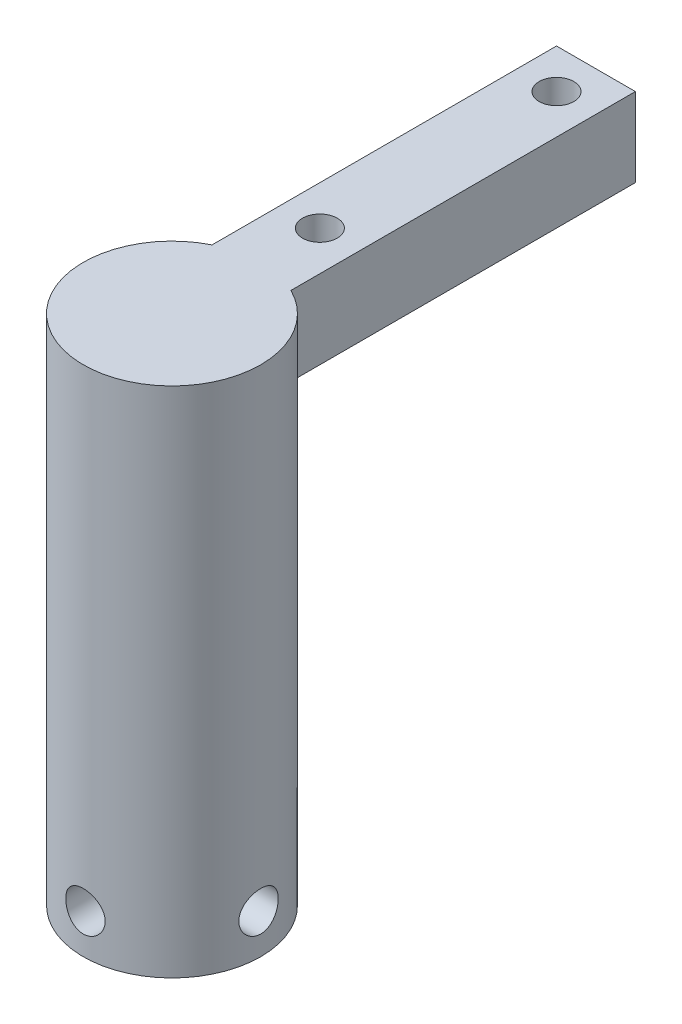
ISO-10303-21;
HEADER;
FILE_DESCRIPTION(('STEP AP214'),'2;1');
FILE_NAME('part.step','',(''),(''),'','','');
FILE_SCHEMA(('AUTOMOTIVE_DESIGN { 1 0 10303 214 1 1 1 1 }'));
ENDSEC;
DATA;
#1=APPLICATION_CONTEXT('core data for automotive mechanical design processes');
#2=APPLICATION_PROTOCOL_DEFINITION('international standard','automotive_design',2000,#1);
#3=PRODUCT_CONTEXT('',#1,'mechanical');
#4=PRODUCT('Part','Part','',(#3));
#5=PRODUCT_RELATED_PRODUCT_CATEGORY('part','',(#4));
#6=PRODUCT_DEFINITION_FORMATION('','',#4);
#7=PRODUCT_DEFINITION_CONTEXT('part definition',#1,'design');
#8=PRODUCT_DEFINITION('design','',#6,#7);
#9=PRODUCT_DEFINITION_SHAPE('','',#8);
#10=(LENGTH_UNIT() NAMED_UNIT(*) SI_UNIT(.MILLI.,.METRE.));
#11=(NAMED_UNIT(*) PLANE_ANGLE_UNIT() SI_UNIT($,.RADIAN.));
#12=(NAMED_UNIT(*) SI_UNIT($,.STERADIAN.) SOLID_ANGLE_UNIT());
#13=UNCERTAINTY_MEASURE_WITH_UNIT(LENGTH_MEASURE(1.E-05),#10,'distance_accuracy_value','');
#14=(GEOMETRIC_REPRESENTATION_CONTEXT(3) GLOBAL_UNCERTAINTY_ASSIGNED_CONTEXT((#13)) GLOBAL_UNIT_ASSIGNED_CONTEXT((#10,
#11,#12)) REPRESENTATION_CONTEXT('',''));
#15=CARTESIAN_POINT('',(0.,0.,0.));
#16=DIRECTION('',(0.,0.,1.));
#17=DIRECTION('',(1.,0.,0.));
#18=AXIS2_PLACEMENT_3D('',#15,#16,#17);
#19=CARTESIAN_POINT('',(0.,-130.,0.));
#20=DIRECTION('',(0.,1.,0.));
#21=DIRECTION('',(0.,0.,1.));
#22=AXIS2_PLACEMENT_3D('',#19,#20,#21);
#23=CYLINDRICAL_SURFACE('',#22,22.5);
#24=CARTESIAN_POINT('',(-21.9374109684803,-120.,-5.));
#25=CARTESIAN_POINT('',(-21.9374165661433,-120.27710591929,-4.9999906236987));
#26=CARTESIAN_POINT('',(-21.942718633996,-120.554323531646,-4.97688532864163));
#27=CARTESIAN_POINT('',(-21.9633134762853,-121.100867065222,-4.88518059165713));
#28=CARTESIAN_POINT('',(-21.9786133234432,-121.37018725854,-4.81654894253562));
#29=CARTESIAN_POINT('',(-22.0173873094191,-121.892951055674,-4.63606595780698));
#30=CARTESIAN_POINT('',(-22.0408523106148,-122.146412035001,-4.52426292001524));
#31=CARTESIAN_POINT('',(-22.0933016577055,-122.630987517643,-4.26075008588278));
#32=CARTESIAN_POINT('',(-22.1222859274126,-122.862102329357,-4.1090408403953));
#33=CARTESIAN_POINT('',(-22.1830725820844,-123.299456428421,-3.76720268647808));
#34=CARTESIAN_POINT('',(-22.2149119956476,-123.505249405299,-3.57650924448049));
#35=CARTESIAN_POINT('',(-22.277497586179,-123.882206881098,-3.16333419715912));
#36=CARTESIAN_POINT('',(-22.3082436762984,-124.053368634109,-2.94085007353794));
#37=CARTESIAN_POINT('',(-22.3655823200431,-124.357976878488,-2.4674098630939));
#38=CARTESIAN_POINT('',(-22.3921260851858,-124.490993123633,-2.21617054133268));
#39=CARTESIAN_POINT('',(-22.4376506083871,-124.712749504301,-1.69421583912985));
#40=CARTESIAN_POINT('',(-22.4566322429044,-124.801494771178,-1.42350272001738));
#41=CARTESIAN_POINT('',(-22.4846321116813,-124.930783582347,-0.874926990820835));
#42=CARTESIAN_POINT('',(-22.4938063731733,-124.972082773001,-0.597250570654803));
#43=CARTESIAN_POINT('',(-22.501698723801,-125.007670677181,-0.0387691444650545));
#44=CARTESIAN_POINT('',(-22.5004180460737,-125.001964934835,0.242035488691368));
#45=CARTESIAN_POINT('',(-22.4876637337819,-124.94426569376,0.793589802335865));
#46=CARTESIAN_POINT('',(-22.4763694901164,-124.893086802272,1.06442946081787));
#47=CARTESIAN_POINT('',(-22.4450619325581,-124.747193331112,1.59357711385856));
#48=CARTESIAN_POINT('',(-22.4250482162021,-124.652476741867,1.85188452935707));
#49=CARTESIAN_POINT('',(-22.3782634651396,-124.421482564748,2.35088442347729));
#50=CARTESIAN_POINT('',(-22.3514428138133,-124.284898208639,2.59143005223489));
#51=CARTESIAN_POINT('',(-22.293981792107,-123.974274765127,3.0464828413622));
#52=CARTESIAN_POINT('',(-22.2633408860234,-123.800230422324,3.26098634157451));
#53=CARTESIAN_POINT('',(-22.2008291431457,-123.415199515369,3.6627124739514));
#54=CARTESIAN_POINT('',(-22.1689460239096,-123.203500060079,3.849250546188));
#55=CARTESIAN_POINT('',(-22.1081580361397,-122.751493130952,4.1843075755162));
#56=CARTESIAN_POINT('',(-22.0792532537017,-122.511184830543,4.33282543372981));
#57=CARTESIAN_POINT('',(-22.027660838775,-122.007650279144,4.58794414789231));
#58=CARTESIAN_POINT('',(-22.0049930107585,-121.744354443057,4.69441193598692));
#59=CARTESIAN_POINT('',(-21.9687128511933,-121.202984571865,4.86138173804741));
#60=CARTESIAN_POINT('',(-21.9550990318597,-120.924912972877,4.92189130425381));
#61=CARTESIAN_POINT('',(-21.9387727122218,-120.368150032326,4.99415747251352));
#62=CARTESIAN_POINT('',(-21.9358370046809,-120.089594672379,5.00691246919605));
#63=CARTESIAN_POINT('',(-21.9405966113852,-119.534337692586,4.98601368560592));
#64=CARTESIAN_POINT('',(-21.9482911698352,-119.257635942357,4.95236320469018));
#65=CARTESIAN_POINT('',(-21.973233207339,-118.717441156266,4.84047593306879));
#66=CARTESIAN_POINT('',(-21.9903620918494,-118.453827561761,4.76279231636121));
#67=CARTESIAN_POINT('',(-22.0321352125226,-117.943358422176,4.56564437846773));
#68=CARTESIAN_POINT('',(-22.0567801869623,-117.696504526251,4.44617595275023));
#69=CARTESIAN_POINT('',(-22.1112968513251,-117.22225099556,4.16666175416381));
#70=CARTESIAN_POINT('',(-22.1412451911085,-116.995221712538,4.00600286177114));
#71=CARTESIAN_POINT('',(-22.2027935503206,-116.570979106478,3.6494676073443));
#72=CARTESIAN_POINT('',(-22.2343937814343,-116.373769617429,3.45358672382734));
#73=CARTESIAN_POINT('',(-22.2964233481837,-116.010871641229,3.02764303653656));
#74=CARTESIAN_POINT('',(-22.3268183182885,-115.845864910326,2.7969935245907));
#75=CARTESIAN_POINT('',(-22.3823727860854,-115.556939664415,2.31067040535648));
#76=CARTESIAN_POINT('',(-22.4075325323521,-115.433019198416,2.05499798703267));
#77=CARTESIAN_POINT('',(-22.4496372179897,-115.230724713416,1.52750475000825));
#78=CARTESIAN_POINT('',(-22.4666350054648,-115.152057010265,1.25580097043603));
#79=CARTESIAN_POINT('',(-22.4907294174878,-115.041587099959,0.702612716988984));
#80=CARTESIAN_POINT('',(-22.4978275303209,-115.009777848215,0.421129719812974));
#81=CARTESIAN_POINT('',(-22.501276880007,-114.994253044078,-0.137162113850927));
#82=CARTESIAN_POINT('',(-22.4978552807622,-115.009520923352,-0.413941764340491));
#83=CARTESIAN_POINT('',(-22.481138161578,-115.085437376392,-0.960885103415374));
#84=CARTESIAN_POINT('',(-22.4678428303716,-115.146085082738,-1.23104891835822));
#85=CARTESIAN_POINT('',(-22.4328909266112,-115.310545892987,-1.7562757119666));
#86=CARTESIAN_POINT('',(-22.4112631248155,-115.414210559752,-2.01138720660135));
#87=CARTESIAN_POINT('',(-22.3619521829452,-115.661619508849,-2.50072882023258));
#88=CARTESIAN_POINT('',(-22.3342684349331,-115.805367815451,-2.73495683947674));
#89=CARTESIAN_POINT('',(-22.2751870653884,-116.132155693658,-3.18082724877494));
#90=CARTESIAN_POINT('',(-22.2437274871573,-116.315907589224,-3.39193939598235));
#91=CARTESIAN_POINT('',(-22.1809676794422,-116.716055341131,-3.7806793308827));
#92=CARTESIAN_POINT('',(-22.1496674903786,-116.932459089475,-3.95829899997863));
#93=CARTESIAN_POINT('',(-22.0902842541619,-117.39538624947,-4.27739627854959));
#94=CARTESIAN_POINT('',(-22.0622519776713,-117.642286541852,-4.41833714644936));
#95=CARTESIAN_POINT('',(-22.0132210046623,-118.156842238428,-4.65650065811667));
#96=CARTESIAN_POINT('',(-21.9922164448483,-118.424480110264,-4.75375976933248));
#97=CARTESIAN_POINT('',(-21.9634405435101,-118.910266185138,-4.88473373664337));
#98=CARTESIAN_POINT('',(-21.9537451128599,-119.125808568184,-4.92787455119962));
#99=CARTESIAN_POINT('',(-21.9407282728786,-119.56087739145,-4.98551065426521));
#100=CARTESIAN_POINT('',(-21.9374065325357,-119.780403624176,-5.0000074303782));
#101=CARTESIAN_POINT('',(-21.9374109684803,-120.,-5.));
#102=B_SPLINE_CURVE_WITH_KNOTS('',3,(#24,#25,#26,#27,#28,#29,#30,#31,#32,#33,#34,#35,#36,#37,
#38,#39,#40,#41,#42,#43,#44,#45,#46,#47,#48,#49,#50,#51,#52,#53,#54,#55,#56,#57,#58,#59,#60,#61,
#62,#63,#64,#65,#66,#67,#68,#69,#70,#71,#72,#73,#74,#75,#76,#77,#78,#79,#80,#81,#82,#83,#84,#85,
#86,#87,#88,#89,#90,#91,#92,#93,#94,#95,#96,#97,#98,#99,#100,#101),.UNSPECIFIED.,.T.,.F.,(4,2,2,
2,2,2,2,2,2,2,2,2,2,2,2,2,2,2,2,2,2,2,2,2,2,2,2,2,2,2,2,2,2,2,2,2,2,2,4),(0.,0.830512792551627,
1.66161375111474,2.49178760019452,3.32194999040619,4.16511484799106,5.00834653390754,
5.86074531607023,6.71304527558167,7.55157428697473,8.39000439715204,9.21371104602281,
10.0374557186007,10.8673864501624,11.6974336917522,12.5453011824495,13.3931931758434,
14.2437472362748,15.09416149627,15.9266937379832,16.759166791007,17.5814064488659,
18.403726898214,19.239080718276,20.0745418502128,20.9261261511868,21.7776700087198,
22.6236232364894,23.4694492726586,24.29713968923,25.1248142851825,25.9496562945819,
26.7745811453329,27.6156117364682,28.4568459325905,29.3097742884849,30.1619892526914,
30.8201746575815,31.4783258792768),.UNSPECIFIED.);
#103=CARTESIAN_POINT('',(-21.9374109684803,-120.,-5.));
#104=VERTEX_POINT('',#103);
#105=EDGE_CURVE('E136',#104,#104,#102,.T.);
#106=ORIENTED_EDGE('',*,*,#105,.F.);
#107=EDGE_LOOP('',(#106));
#108=FACE_BOUND('',#107,.T.);
#109=CARTESIAN_POINT('',(0.,-125.,22.5));
#110=CARTESIAN_POINT('',(-0.277201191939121,-124.9999906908,22.4999949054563));
#111=CARTESIAN_POINT('',(-0.554513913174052,-124.976870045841,22.4948253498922));
#112=CARTESIAN_POINT('',(-1.10125486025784,-124.885098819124,22.4747024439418));
#113=CARTESIAN_POINT('',(-1.37067743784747,-124.816416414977,22.4597422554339));
#114=CARTESIAN_POINT('',(-1.89365819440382,-124.635785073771,22.421702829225));
#115=CARTESIAN_POINT('',(-2.14723288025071,-124.523882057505,22.3986322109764));
#116=CARTESIAN_POINT('',(-2.63200045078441,-124.260133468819,22.3468583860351));
#117=CARTESIAN_POINT('',(-2.86319376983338,-124.108288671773,22.3181552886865));
#118=CARTESIAN_POINT('',(-3.30046578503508,-123.766310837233,22.2577273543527));
#119=CARTESIAN_POINT('',(-3.50612153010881,-123.575643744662,22.2259640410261));
#120=CARTESIAN_POINT('',(-3.88281227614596,-123.162579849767,22.1632650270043));
#121=CARTESIAN_POINT('',(-4.05384411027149,-122.940180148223,22.132329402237));
#122=CARTESIAN_POINT('',(-4.35831108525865,-122.466820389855,22.0744082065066));
#123=CARTESIAN_POINT('',(-4.49129355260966,-122.2155626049,22.0474718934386));
#124=CARTESIAN_POINT('',(-4.71298247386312,-121.693568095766,22.0011524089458));
#125=CARTESIAN_POINT('',(-4.80169440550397,-121.422833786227,21.9817683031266));
#126=CARTESIAN_POINT('',(-4.93092145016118,-120.874166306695,21.9531402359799));
#127=CARTESIAN_POINT('',(-4.97218667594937,-120.59641821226,21.9437386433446));
#128=CARTESIAN_POINT('',(-5.00768177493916,-120.037794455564,21.9356668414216));
#129=CARTESIAN_POINT('',(-5.00191762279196,-119.756919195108,21.9369952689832));
#130=CARTESIAN_POINT('',(-4.94412068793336,-119.205608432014,21.9500908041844));
#131=CARTESIAN_POINT('',(-4.89296161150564,-118.935075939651,21.9616607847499));
#132=CARTESIAN_POINT('',(-4.74721226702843,-118.406532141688,21.993623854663));
#133=CARTESIAN_POINT('',(-4.65261949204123,-118.148521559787,22.0140174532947));
#134=CARTESIAN_POINT('',(-4.42189182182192,-117.649901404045,22.0615227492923));
#135=CARTESIAN_POINT('',(-4.28542298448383,-117.40945168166,22.0886881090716));
#136=CARTESIAN_POINT('',(-3.97505170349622,-116.95454282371,22.1466434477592));
#137=CARTESIAN_POINT('',(-3.80114400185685,-116.74008734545,22.1774339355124));
#138=CARTESIAN_POINT('',(-3.41621709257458,-116.338226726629,22.2400143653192));
#139=CARTESIAN_POINT('',(-3.20445551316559,-116.151533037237,22.2718112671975));
#140=CARTESIAN_POINT('',(-2.75226654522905,-115.816190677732,22.3321959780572));
#141=CARTESIAN_POINT('',(-2.51183860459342,-115.667542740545,22.3607837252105));
#142=CARTESIAN_POINT('',(-2.00825797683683,-115.412326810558,22.4116266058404));
#143=CARTESIAN_POINT('',(-1.74505530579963,-115.305854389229,22.4338673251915));
#144=CARTESIAN_POINT('',(-1.20388982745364,-115.138847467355,22.4694034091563));
#145=CARTESIAN_POINT('',(-0.925929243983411,-115.078306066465,22.4827001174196));
#146=CARTESIAN_POINT('',(-0.369238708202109,-115.005919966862,22.4986579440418));
#147=CARTESIAN_POINT('',(-0.0906409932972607,-114.993103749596,22.5015312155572));
#148=CARTESIAN_POINT('',(0.464714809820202,-115.013895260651,22.496913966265));
#149=CARTESIAN_POINT('',(0.741473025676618,-115.047499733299,22.4894241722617));
#150=CARTESIAN_POINT('',(1.28205814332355,-115.15937353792,22.4650564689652));
#151=CARTESIAN_POINT('',(1.5459962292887,-115.237131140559,22.4482861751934));
#152=CARTESIAN_POINT('',(2.05708201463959,-115.434534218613,22.4072355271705));
#153=CARTESIAN_POINT('',(2.30422825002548,-115.554183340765,22.3829545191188));
#154=CARTESIAN_POINT('',(2.77871609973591,-115.833982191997,22.3290538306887));
#155=CARTESIAN_POINT('',(3.00571432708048,-115.994699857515,22.2993611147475));
#156=CARTESIAN_POINT('',(3.42986741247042,-116.351328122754,22.2380758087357));
#157=CARTESIAN_POINT('',(3.62701825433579,-116.547243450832,22.2064829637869));
#158=CARTESIAN_POINT('',(3.98973870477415,-116.97317008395,22.1442219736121));
#159=CARTESIAN_POINT('',(4.1546345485,-117.203760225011,22.1135829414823));
#160=CARTESIAN_POINT('',(4.44336529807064,-117.689930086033,22.0573848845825));
#161=CARTESIAN_POINT('',(4.5672019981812,-117.945508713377,22.0318256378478));
#162=CARTESIAN_POINT('',(4.76945004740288,-118.473020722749,21.9889300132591));
#163=CARTESIAN_POINT('',(4.84811965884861,-118.744851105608,21.9715469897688));
#164=CARTESIAN_POINT('',(4.95855069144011,-119.298310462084,21.9468912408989));
#165=CARTESIAN_POINT('',(4.99031989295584,-119.579937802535,21.9396168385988));
#166=CARTESIAN_POINT('',(5.00570891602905,-120.138197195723,21.936110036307));
#167=CARTESIAN_POINT('',(4.99039782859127,-120.414798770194,21.9396324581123));
#168=CARTESIAN_POINT('',(4.91445692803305,-120.96137427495,21.956766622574));
#169=CARTESIAN_POINT('',(4.85382768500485,-121.231348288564,21.9703782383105));
#170=CARTESIAN_POINT('',(4.68949549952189,-121.756122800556,22.0060357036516));
#171=CARTESIAN_POINT('',(4.58595291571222,-122.010975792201,22.0280501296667));
#172=CARTESIAN_POINT('',(4.33886925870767,-122.49984998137,22.078044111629));
#173=CARTESIAN_POINT('',(4.1953238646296,-122.733868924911,22.1060243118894));
#174=CARTESIAN_POINT('',(3.86878397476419,-123.179691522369,22.1655260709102));
#175=CARTESIAN_POINT('',(3.68502963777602,-123.390930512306,22.1971092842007));
#176=CARTESIAN_POINT('',(3.28482176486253,-123.779925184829,22.2598493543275));
#177=CARTESIAN_POINT('',(3.06836066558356,-123.957673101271,22.2910061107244));
#178=CARTESIAN_POINT('',(2.60536492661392,-124.2769399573,22.3498814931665));
#179=CARTESIAN_POINT('',(2.35846409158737,-124.417937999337,22.3775480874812));
#180=CARTESIAN_POINT('',(1.84390069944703,-124.656208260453,22.4258014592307));
#181=CARTESIAN_POINT('',(1.57625550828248,-124.753516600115,22.4463940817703));
#182=CARTESIAN_POINT('',(1.09034561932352,-124.884603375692,22.474570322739));
#183=CARTESIAN_POINT('',(0.874679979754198,-124.927793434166,22.4840467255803));
#184=CARTESIAN_POINT('',(0.439366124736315,-124.985494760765,22.4967634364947));
#185=CARTESIAN_POINT('',(0.219718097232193,-125.000007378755,22.5000040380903));
#186=CARTESIAN_POINT('',(0.,-125.,22.5));
#187=B_SPLINE_CURVE_WITH_KNOTS('',3,(#109,#110,#111,#112,#113,#114,#115,#116,#117,#118,#119,
#120,#121,#122,#123,#124,#125,#126,#127,#128,#129,#130,#131,#132,#133,#134,#135,#136,#137,#138,
#139,#140,#141,#142,#143,#144,#145,#146,#147,#148,#149,#150,#151,#152,#153,#154,#155,#156,#157,
#158,#159,#160,#161,#162,#163,#164,#165,#166,#167,#168,#169,#170,#171,#172,#173,#174,#175,#176,
#177,#178,#179,#180,#181,#182,#183,#184,#185,#186),.UNSPECIFIED.,.T.,.F.,(4,2,2,2,2,2,2,2,2,2,2,
2,2,2,2,2,2,2,2,2,2,2,2,2,2,2,2,2,2,2,2,2,2,2,2,2,2,2,4),(0.,0.830799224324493,1.66217932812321,
2.49267853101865,3.32316161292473,4.16595180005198,5.00881903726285,5.86133240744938,
6.7137402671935,7.55247814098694,8.39110946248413,9.21394170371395,10.0368214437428,
10.8664417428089,11.6961786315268,12.5444544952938,13.392746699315,14.2429503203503,
15.093026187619,15.9256998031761,16.758315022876,17.5814717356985,18.4047001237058,
19.2399950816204,20.0754023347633,20.9267368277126,21.7780341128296,22.6244139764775,
23.4706534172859,24.2978196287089,25.1249754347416,25.9490678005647,26.7732492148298,
27.6146081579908,28.4561619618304,29.3090646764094,30.1612609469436,30.8198086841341,
31.4783254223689),.UNSPECIFIED.);
#188=CARTESIAN_POINT('',(0.,-125.,22.5));
#189=VERTEX_POINT('',#188);
#190=EDGE_CURVE('E115',#189,#189,#187,.T.);
#191=ORIENTED_EDGE('',*,*,#190,.T.);
#192=EDGE_LOOP('',(#191));
#193=FACE_BOUND('',#192,.T.);
#194=CARTESIAN_POINT('',(0.,-130.,0.));
#195=DIRECTION('',(0.,1.,0.));
#196=DIRECTION('',(1.,0.,0.));
#197=AXIS2_PLACEMENT_3D('',#194,#195,#196);
#198=CIRCLE('',#197,22.5);
#199=CARTESIAN_POINT('',(22.5,-130.,0.));
#200=VERTEX_POINT('',#199);
#201=EDGE_CURVE('E11',#200,#200,#198,.T.);
#202=ORIENTED_EDGE('',*,*,#201,.T.);
#203=EDGE_LOOP('',(#202));
#204=FACE_BOUND('',#203,.T.);
#205=CARTESIAN_POINT('',(0.,0.,0.));
#206=DIRECTION('',(0.,1.,0.));
#207=DIRECTION('',(1.,0.,0.));
#208=AXIS2_PLACEMENT_3D('',#205,#206,#207);
#209=CIRCLE('',#208,22.5);
#210=CARTESIAN_POINT('',(-10.,0.,-20.1556443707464));
#211=VERTEX_POINT('',#210);
#212=CARTESIAN_POINT('',(9.99999999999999,0.,-20.1556443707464));
#213=VERTEX_POINT('',#212);
#214=EDGE_CURVE('E25',#211,#213,#209,.T.);
#215=ORIENTED_EDGE('',*,*,#214,.F.);
#216=DIRECTION('',(0.,1.,0.));
#217=VECTOR('',#216,1.);
#218=CARTESIAN_POINT('',(-10.,-20.,-20.1556443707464));
#219=LINE('',#218,#217);
#220=CARTESIAN_POINT('',(-10.,-20.,-20.1556443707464));
#221=VERTEX_POINT('',#220);
#222=EDGE_CURVE('E76',#221,#211,#219,.T.);
#223=ORIENTED_EDGE('',*,*,#222,.F.);
#224=CARTESIAN_POINT('',(0.,-20.,0.));
#225=DIRECTION('',(0.,1.,0.));
#226=DIRECTION('',(1.,0.,0.));
#227=AXIS2_PLACEMENT_3D('',#224,#225,#226);
#228=CIRCLE('',#227,22.5);
#229=CARTESIAN_POINT('',(9.99999999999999,-20.,-20.1556443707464));
#230=VERTEX_POINT('',#229);
#231=EDGE_CURVE('E40',#230,#221,#228,.T.);
#232=ORIENTED_EDGE('',*,*,#231,.F.);
#233=DIRECTION('',(0.,1.,0.));
#234=VECTOR('',#233,1.);
#235=CARTESIAN_POINT('',(9.99999999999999,-20.,-20.1556443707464));
#236=LINE('',#235,#234);
#237=EDGE_CURVE('E96',#230,#213,#236,.T.);
#238=ORIENTED_EDGE('',*,*,#237,.T.);
#239=EDGE_LOOP('',(#215,#223,#232,#238));
#240=FACE_BOUND('',#239,.T.);
#241=CARTESIAN_POINT('',(5.,-120.,-21.9374109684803));
#242=CARTESIAN_POINT('',(4.99999062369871,-120.27710591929,-21.9374165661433));
#243=CARTESIAN_POINT('',(4.97688532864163,-120.554323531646,-21.942718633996));
#244=CARTESIAN_POINT('',(4.88518059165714,-121.100867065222,-21.9633134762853));
#245=CARTESIAN_POINT('',(4.81654894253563,-121.37018725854,-21.9786133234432));
#246=CARTESIAN_POINT('',(4.63606595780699,-121.892951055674,-22.0173873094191));
#247=CARTESIAN_POINT('',(4.52426292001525,-122.146412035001,-22.0408523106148));
#248=CARTESIAN_POINT('',(4.26075008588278,-122.630987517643,-22.0933016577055));
#249=CARTESIAN_POINT('',(4.10904084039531,-122.862102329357,-22.1222859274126));
#250=CARTESIAN_POINT('',(3.76720268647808,-123.299456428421,-22.1830725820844));
#251=CARTESIAN_POINT('',(3.57650924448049,-123.505249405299,-22.2149119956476));
#252=CARTESIAN_POINT('',(3.16333419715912,-123.882206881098,-22.277497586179));
#253=CARTESIAN_POINT('',(2.94085007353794,-124.053368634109,-22.3082436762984));
#254=CARTESIAN_POINT('',(2.46740986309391,-124.357976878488,-22.3655823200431));
#255=CARTESIAN_POINT('',(2.21617054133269,-124.490993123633,-22.3921260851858));
#256=CARTESIAN_POINT('',(1.69421583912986,-124.712749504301,-22.4376506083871));
#257=CARTESIAN_POINT('',(1.42350272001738,-124.801494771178,-22.4566322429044));
#258=CARTESIAN_POINT('',(0.874926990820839,-124.930783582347,-22.4846321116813));
#259=CARTESIAN_POINT('',(0.597250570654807,-124.972082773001,-22.4938063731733));
#260=CARTESIAN_POINT('',(0.0387691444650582,-125.007670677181,-22.501698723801));
#261=CARTESIAN_POINT('',(-0.242035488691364,-125.001964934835,-22.5004180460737));
#262=CARTESIAN_POINT('',(-0.793589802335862,-124.94426569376,-22.4876637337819));
#263=CARTESIAN_POINT('',(-1.06442946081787,-124.893086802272,-22.4763694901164));
#264=CARTESIAN_POINT('',(-1.59357711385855,-124.747193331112,-22.4450619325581));
#265=CARTESIAN_POINT('',(-1.85188452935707,-124.652476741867,-22.4250482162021));
#266=CARTESIAN_POINT('',(-2.35088442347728,-124.421482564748,-22.3782634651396));
#267=CARTESIAN_POINT('',(-2.59143005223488,-124.284898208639,-22.3514428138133));
#268=CARTESIAN_POINT('',(-3.0464828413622,-123.974274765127,-22.293981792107));
#269=CARTESIAN_POINT('',(-3.2609863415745,-123.800230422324,-22.2633408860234));
#270=CARTESIAN_POINT('',(-3.6627124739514,-123.415199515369,-22.2008291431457));
#271=CARTESIAN_POINT('',(-3.849250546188,-123.203500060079,-22.1689460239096));
#272=CARTESIAN_POINT('',(-4.1843075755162,-122.751493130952,-22.1081580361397));
#273=CARTESIAN_POINT('',(-4.3328254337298,-122.511184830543,-22.0792532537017));
#274=CARTESIAN_POINT('',(-4.58794414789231,-122.007650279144,-22.027660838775));
#275=CARTESIAN_POINT('',(-4.69441193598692,-121.744354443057,-22.0049930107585));
#276=CARTESIAN_POINT('',(-4.8613817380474,-121.202984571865,-21.9687128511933));
#277=CARTESIAN_POINT('',(-4.92189130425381,-120.924912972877,-21.9550990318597));
#278=CARTESIAN_POINT('',(-4.99415747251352,-120.368150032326,-21.9387727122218));
#279=CARTESIAN_POINT('',(-5.00691246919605,-120.089594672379,-21.9358370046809));
#280=CARTESIAN_POINT('',(-4.98601368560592,-119.534337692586,-21.9405966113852));
#281=CARTESIAN_POINT('',(-4.95236320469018,-119.257635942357,-21.9482911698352));
#282=CARTESIAN_POINT('',(-4.84047593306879,-118.717441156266,-21.973233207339));
#283=CARTESIAN_POINT('',(-4.76279231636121,-118.453827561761,-21.9903620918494));
#284=CARTESIAN_POINT('',(-4.56564437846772,-117.943358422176,-22.0321352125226));
#285=CARTESIAN_POINT('',(-4.44617595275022,-117.696504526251,-22.0567801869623));
#286=CARTESIAN_POINT('',(-4.1666617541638,-117.22225099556,-22.1112968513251));
#287=CARTESIAN_POINT('',(-4.00600286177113,-116.995221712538,-22.1412451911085));
#288=CARTESIAN_POINT('',(-3.6494676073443,-116.570979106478,-22.2027935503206));
#289=CARTESIAN_POINT('',(-3.45358672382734,-116.373769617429,-22.2343937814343));
#290=CARTESIAN_POINT('',(-3.02764303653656,-116.010871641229,-22.2964233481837));
#291=CARTESIAN_POINT('',(-2.7969935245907,-115.845864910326,-22.3268183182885));
#292=CARTESIAN_POINT('',(-2.31067040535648,-115.556939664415,-22.3823727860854));
#293=CARTESIAN_POINT('',(-2.05499798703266,-115.433019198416,-22.4075325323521));
#294=CARTESIAN_POINT('',(-1.52750475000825,-115.230724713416,-22.4496372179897));
#295=CARTESIAN_POINT('',(-1.25580097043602,-115.152057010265,-22.4666350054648));
#296=CARTESIAN_POINT('',(-0.70261271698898,-115.041587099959,-22.4907294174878));
#297=CARTESIAN_POINT('',(-0.421129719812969,-115.009777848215,-22.4978275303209));
#298=CARTESIAN_POINT('',(0.137162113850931,-114.994253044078,-22.501276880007));
#299=CARTESIAN_POINT('',(0.413941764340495,-115.009520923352,-22.4978552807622));
#300=CARTESIAN_POINT('',(0.960885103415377,-115.085437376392,-22.481138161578));
#301=CARTESIAN_POINT('',(1.23104891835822,-115.146085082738,-22.4678428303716));
#302=CARTESIAN_POINT('',(1.7562757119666,-115.310545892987,-22.4328909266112));
#303=CARTESIAN_POINT('',(2.01138720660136,-115.414210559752,-22.4112631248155));
#304=CARTESIAN_POINT('',(2.50072882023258,-115.661619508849,-22.3619521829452));
#305=CARTESIAN_POINT('',(2.73495683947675,-115.805367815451,-22.3342684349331));
#306=CARTESIAN_POINT('',(3.18082724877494,-116.132155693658,-22.2751870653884));
#307=CARTESIAN_POINT('',(3.39193939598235,-116.315907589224,-22.2437274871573));
#308=CARTESIAN_POINT('',(3.78067933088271,-116.716055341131,-22.1809676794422));
#309=CARTESIAN_POINT('',(3.95829899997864,-116.932459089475,-22.1496674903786));
#310=CARTESIAN_POINT('',(4.27739627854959,-117.39538624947,-22.0902842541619));
#311=CARTESIAN_POINT('',(4.41833714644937,-117.642286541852,-22.0622519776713));
#312=CARTESIAN_POINT('',(4.65650065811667,-118.156842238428,-22.0132210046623));
#313=CARTESIAN_POINT('',(4.75375976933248,-118.424480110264,-21.9922164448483));
#314=CARTESIAN_POINT('',(4.88473373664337,-118.910266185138,-21.9634405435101));
#315=CARTESIAN_POINT('',(4.92787455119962,-119.125808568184,-21.9537451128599));
#316=CARTESIAN_POINT('',(4.98551065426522,-119.56087739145,-21.9407282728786));
#317=CARTESIAN_POINT('',(5.0000074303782,-119.780403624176,-21.9374065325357));
#318=CARTESIAN_POINT('',(5.,-120.,-21.9374109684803));
#319=B_SPLINE_CURVE_WITH_KNOTS('',3,(#241,#242,#243,#244,#245,#246,#247,#248,#249,#250,#251,
#252,#253,#254,#255,#256,#257,#258,#259,#260,#261,#262,#263,#264,#265,#266,#267,#268,#269,#270,
#271,#272,#273,#274,#275,#276,#277,#278,#279,#280,#281,#282,#283,#284,#285,#286,#287,#288,#289,
#290,#291,#292,#293,#294,#295,#296,#297,#298,#299,#300,#301,#302,#303,#304,#305,#306,#307,#308,
#309,#310,#311,#312,#313,#314,#315,#316,#317,#318),.UNSPECIFIED.,.T.,.F.,(4,2,2,2,2,2,2,2,2,2,2,
2,2,2,2,2,2,2,2,2,2,2,2,2,2,2,2,2,2,2,2,2,2,2,2,2,2,2,4),(0.,0.830512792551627,1.66161375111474,
2.49178760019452,3.32194999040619,4.16511484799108,5.00834653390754,5.86074531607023,
6.71304527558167,7.55157428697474,8.39000439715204,9.21371104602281,10.0374557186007,
10.8673864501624,11.6974336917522,12.5453011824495,13.3931931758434,14.2437472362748,
15.09416149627,15.9266937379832,16.759166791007,17.5814064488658,18.403726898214,
19.239080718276,20.0745418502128,20.9261261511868,21.7776700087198,22.6236232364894,
23.4694492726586,24.29713968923,25.1248142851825,25.9496562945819,26.7745811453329,
27.6156117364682,28.4568459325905,29.3097742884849,30.1619892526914,30.8201746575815,
31.4783258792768),.UNSPECIFIED.);
#320=CARTESIAN_POINT('',(5.,-120.,-21.9374109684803));
#321=VERTEX_POINT('',#320);
#322=EDGE_CURVE('E207',#321,#321,#319,.T.);
#323=ORIENTED_EDGE('',*,*,#322,.F.);
#324=EDGE_LOOP('',(#323));
#325=FACE_BOUND('',#324,.T.);
#326=CARTESIAN_POINT('',(21.9374109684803,-120.,5.));
#327=CARTESIAN_POINT('',(21.9374165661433,-119.72289408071,4.99999062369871));
#328=CARTESIAN_POINT('',(21.942718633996,-119.445676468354,4.97688532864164));
#329=CARTESIAN_POINT('',(21.9633134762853,-118.899132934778,4.88518059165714));
#330=CARTESIAN_POINT('',(21.9786133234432,-118.62981274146,4.81654894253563));
#331=CARTESIAN_POINT('',(22.0173873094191,-118.107048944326,4.63606595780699));
#332=CARTESIAN_POINT('',(22.0408523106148,-117.853587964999,4.52426292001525));
#333=CARTESIAN_POINT('',(22.0933016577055,-117.369012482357,4.26075008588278));
#334=CARTESIAN_POINT('',(22.1222859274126,-117.137897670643,4.10904084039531));
#335=CARTESIAN_POINT('',(22.1830725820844,-116.700543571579,3.76720268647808));
#336=CARTESIAN_POINT('',(22.2149119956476,-116.494750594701,3.57650924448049));
#337=CARTESIAN_POINT('',(22.277497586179,-116.117793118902,3.16333419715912));
#338=CARTESIAN_POINT('',(22.3082436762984,-115.946631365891,2.94085007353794));
#339=CARTESIAN_POINT('',(22.3655823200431,-115.642023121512,2.46740986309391));
#340=CARTESIAN_POINT('',(22.3921260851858,-115.509006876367,2.21617054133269));
#341=CARTESIAN_POINT('',(22.4376506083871,-115.287250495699,1.69421583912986));
#342=CARTESIAN_POINT('',(22.4566322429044,-115.198505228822,1.42350272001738));
#343=CARTESIAN_POINT('',(22.4846321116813,-115.069216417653,0.87492699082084));
#344=CARTESIAN_POINT('',(22.4938063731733,-115.027917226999,0.597250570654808));
#345=CARTESIAN_POINT('',(22.501698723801,-114.992329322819,0.0387691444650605));
#346=CARTESIAN_POINT('',(22.5004180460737,-114.998035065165,-0.242035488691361));
#347=CARTESIAN_POINT('',(22.4876637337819,-115.05573430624,-0.793589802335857));
#348=CARTESIAN_POINT('',(22.4763694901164,-115.106913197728,-1.06442946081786));
#349=CARTESIAN_POINT('',(22.4450619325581,-115.252806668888,-1.59357711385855));
#350=CARTESIAN_POINT('',(22.4250482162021,-115.347523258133,-1.85188452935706));
#351=CARTESIAN_POINT('',(22.3782634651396,-115.578517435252,-2.35088442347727));
#352=CARTESIAN_POINT('',(22.3514428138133,-115.715101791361,-2.59143005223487));
#353=CARTESIAN_POINT('',(22.293981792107,-116.025725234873,-3.04648284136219));
#354=CARTESIAN_POINT('',(22.2633408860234,-116.199769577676,-3.2609863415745));
#355=CARTESIAN_POINT('',(22.2008291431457,-116.584800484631,-3.66271247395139));
#356=CARTESIAN_POINT('',(22.1689460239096,-116.796499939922,-3.84925054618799));
#357=CARTESIAN_POINT('',(22.1081580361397,-117.248506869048,-4.18430757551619));
#358=CARTESIAN_POINT('',(22.0792532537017,-117.488815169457,-4.3328254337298));
#359=CARTESIAN_POINT('',(22.027660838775,-117.992349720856,-4.5879441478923));
#360=CARTESIAN_POINT('',(22.0049930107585,-118.255645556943,-4.69441193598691));
#361=CARTESIAN_POINT('',(21.9687128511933,-118.797015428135,-4.8613817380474));
#362=CARTESIAN_POINT('',(21.9550990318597,-119.075087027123,-4.9218913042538));
#363=CARTESIAN_POINT('',(21.9387727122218,-119.631849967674,-4.99415747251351));
#364=CARTESIAN_POINT('',(21.9358370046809,-119.910405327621,-5.00691246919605));
#365=CARTESIAN_POINT('',(21.9405966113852,-120.465662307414,-4.98601368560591));
#366=CARTESIAN_POINT('',(21.9482911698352,-120.742364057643,-4.95236320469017));
#367=CARTESIAN_POINT('',(21.973233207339,-121.282558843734,-4.84047593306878));
#368=CARTESIAN_POINT('',(21.9903620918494,-121.546172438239,-4.76279231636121));
#369=CARTESIAN_POINT('',(22.0321352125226,-122.056641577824,-4.56564437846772));
#370=CARTESIAN_POINT('',(22.0567801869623,-122.303495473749,-4.44617595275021));
#371=CARTESIAN_POINT('',(22.1112968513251,-122.777749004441,-4.1666617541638));
#372=CARTESIAN_POINT('',(22.1412451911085,-123.004778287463,-4.00600286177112));
#373=CARTESIAN_POINT('',(22.2027935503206,-123.429020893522,-3.64946760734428));
#374=CARTESIAN_POINT('',(22.2343937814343,-123.626230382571,-3.45358672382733));
#375=CARTESIAN_POINT('',(22.2964233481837,-123.989128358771,-3.02764303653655));
#376=CARTESIAN_POINT('',(22.3268183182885,-124.154135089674,-2.79699352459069));
#377=CARTESIAN_POINT('',(22.3823727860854,-124.443060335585,-2.31067040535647));
#378=CARTESIAN_POINT('',(22.4075325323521,-124.566980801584,-2.05499798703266));
#379=CARTESIAN_POINT('',(22.4496372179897,-124.769275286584,-1.52750475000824));
#380=CARTESIAN_POINT('',(22.4666350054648,-124.847942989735,-1.25580097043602));
#381=CARTESIAN_POINT('',(22.4907294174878,-124.958412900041,-0.702612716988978));
#382=CARTESIAN_POINT('',(22.4978275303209,-124.990222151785,-0.421129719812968));
#383=CARTESIAN_POINT('',(22.501276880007,-125.005746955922,0.137162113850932));
#384=CARTESIAN_POINT('',(22.4978552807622,-124.990479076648,0.413941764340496));
#385=CARTESIAN_POINT('',(22.481138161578,-124.914562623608,0.960885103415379));
#386=CARTESIAN_POINT('',(22.4678428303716,-124.853914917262,1.23104891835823));
#387=CARTESIAN_POINT('',(22.4328909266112,-124.689454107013,1.75627571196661));
#388=CARTESIAN_POINT('',(22.4112631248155,-124.585789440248,2.01138720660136));
#389=CARTESIAN_POINT('',(22.3619521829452,-124.338380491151,2.50072882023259));
#390=CARTESIAN_POINT('',(22.3342684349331,-124.194632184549,2.73495683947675));
#391=CARTESIAN_POINT('',(22.2751870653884,-123.867844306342,3.18082724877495));
#392=CARTESIAN_POINT('',(22.2437274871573,-123.684092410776,3.39193939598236));
#393=CARTESIAN_POINT('',(22.1809676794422,-123.283944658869,3.78067933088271));
#394=CARTESIAN_POINT('',(22.1496674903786,-123.067540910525,3.95829899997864));
#395=CARTESIAN_POINT('',(22.0902842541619,-122.60461375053,4.2773962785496));
#396=CARTESIAN_POINT('',(22.0622519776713,-122.357713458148,4.41833714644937));
#397=CARTESIAN_POINT('',(22.0132210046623,-121.843157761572,4.65650065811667));
#398=CARTESIAN_POINT('',(21.9922164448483,-121.575519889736,4.75375976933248));
#399=CARTESIAN_POINT('',(21.9634405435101,-121.089733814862,4.88473373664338));
#400=CARTESIAN_POINT('',(21.9537451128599,-120.874191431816,4.92787455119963));
#401=CARTESIAN_POINT('',(21.9407282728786,-120.43912260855,4.98551065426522));
#402=CARTESIAN_POINT('',(21.9374065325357,-120.219596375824,5.00000743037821));
#403=CARTESIAN_POINT('',(21.9374109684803,-120.,5.));
#404=B_SPLINE_CURVE_WITH_KNOTS('',3,(#326,#327,#328,#329,#330,#331,#332,#333,#334,#335,#336,
#337,#338,#339,#340,#341,#342,#343,#344,#345,#346,#347,#348,#349,#350,#351,#352,#353,#354,#355,
#356,#357,#358,#359,#360,#361,#362,#363,#364,#365,#366,#367,#368,#369,#370,#371,#372,#373,#374,
#375,#376,#377,#378,#379,#380,#381,#382,#383,#384,#385,#386,#387,#388,#389,#390,#391,#392,#393,
#394,#395,#396,#397,#398,#399,#400,#401,#402,#403),.UNSPECIFIED.,.T.,.F.,(4,2,2,2,2,2,2,2,2,2,2,
2,2,2,2,2,2,2,2,2,2,2,2,2,2,2,2,2,2,2,2,2,2,2,2,2,2,2,4),(0.,0.830512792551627,1.66161375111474,
2.49178760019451,3.32194999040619,4.16511484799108,5.00834653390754,5.86074531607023,
6.71304527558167,7.55157428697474,8.39000439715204,9.21371104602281,10.0374557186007,
10.8673864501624,11.6974336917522,12.5453011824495,13.3931931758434,14.2437472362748,
15.09416149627,15.9266937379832,16.759166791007,17.5814064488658,18.403726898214,
19.239080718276,20.0745418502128,20.9261261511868,21.7776700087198,22.6236232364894,
23.4694492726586,24.29713968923,25.1248142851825,25.9496562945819,26.7745811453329,
27.6156117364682,28.4568459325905,29.3097742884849,30.1619892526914,30.8201746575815,
31.4783258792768),.UNSPECIFIED.);
#405=CARTESIAN_POINT('',(21.9374109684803,-120.,5.));
#406=VERTEX_POINT('',#405);
#407=EDGE_CURVE('E226',#406,#406,#404,.T.);
#408=ORIENTED_EDGE('',*,*,#407,.T.);
#409=EDGE_LOOP('',(#408));
#410=FACE_BOUND('',#409,.T.);
#411=ADVANCED_FACE('F17',(#108,#193,#204,#240,#325,#410),#23,.T.);
#412=CARTESIAN_POINT('',(0.,-60.,0.));
#413=DIRECTION('',(0.,-1.,0.));
#414=DIRECTION('',(0.,0.,-1.));
#415=AXIS2_PLACEMENT_3D('',#412,#413,#414);
#416=CYLINDRICAL_SURFACE('',#415,14.05);
#417=CARTESIAN_POINT('',(-13.1302132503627,-120.,-5.));
#418=CARTESIAN_POINT('',(-13.1302129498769,-119.864466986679,-5.00000034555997));
#419=CARTESIAN_POINT('',(-13.1323174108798,-119.728938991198,-4.99448471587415));
#420=CARTESIAN_POINT('',(-13.1406663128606,-119.458857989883,-4.97247702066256));
#421=CARTESIAN_POINT('',(-13.1469121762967,-119.324305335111,-4.95598118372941));
#422=CARTESIAN_POINT('',(-13.1633388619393,-119.05726650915,-4.91218431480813));
#423=CARTESIAN_POINT('',(-13.1735183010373,-118.924779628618,-4.88488708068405));
#424=CARTESIAN_POINT('',(-13.1974923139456,-118.66271112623,-4.81974063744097));
#425=CARTESIAN_POINT('',(-13.2112883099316,-118.533130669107,-4.78188727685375));
#426=CARTESIAN_POINT('',(-13.2420310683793,-118.278122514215,-4.69608159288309));
#427=CARTESIAN_POINT('',(-13.2589694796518,-118.152684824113,-4.64815599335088));
#428=CARTESIAN_POINT('',(-13.295521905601,-117.90637458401,-4.5425451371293));
#429=CARTESIAN_POINT('',(-13.3151369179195,-117.785503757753,-4.48485623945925));
#430=CARTESIAN_POINT('',(-13.3771757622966,-117.430883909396,-4.29778452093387));
#431=CARTESIAN_POINT('',(-13.4228184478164,-117.204930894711,-4.15433005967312));
#432=CARTESIAN_POINT('',(-13.5197721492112,-116.7706792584,-3.82732714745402));
#433=CARTESIAN_POINT('',(-13.5712380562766,-116.563469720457,-3.64238745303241));
#434=CARTESIAN_POINT('',(-13.6727525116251,-116.182219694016,-3.2405608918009));
#435=CARTESIAN_POINT('',(-13.7228007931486,-116.008185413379,-3.02366805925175));
#436=CARTESIAN_POINT('',(-13.8176612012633,-115.693195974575,-2.55602710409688));
#437=CARTESIAN_POINT('',(-13.8622694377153,-115.553399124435,-2.30445408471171));
#438=CARTESIAN_POINT('',(-13.9393735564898,-115.318547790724,-1.77949583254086));
#439=CARTESIAN_POINT('',(-13.9718731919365,-115.223479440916,-1.50611739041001));
#440=CARTESIAN_POINT('',(-14.0199952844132,-115.084528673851,-0.956690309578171));
#441=CARTESIAN_POINT('',(-14.0362297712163,-115.038784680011,-0.681167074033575));
#442=CARTESIAN_POINT('',(-14.0521776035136,-114.993837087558,-0.125908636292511));
#443=CARTESIAN_POINT('',(-14.0518957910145,-114.994619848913,0.153825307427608));
#444=CARTESIAN_POINT('',(-14.0352441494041,-115.041573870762,0.696300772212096));
#445=CARTESIAN_POINT('',(-14.0195928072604,-115.085718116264,0.959243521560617));
#446=CARTESIAN_POINT('',(-13.9748840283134,-115.21475956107,1.47371079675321));
#447=CARTESIAN_POINT('',(-13.945825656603,-115.299659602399,1.7252345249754));
#448=CARTESIAN_POINT('',(-13.8767081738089,-115.50885577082,2.21388017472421));
#449=CARTESIAN_POINT('',(-13.8365009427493,-115.63368609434,2.45075158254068));
#450=CARTESIAN_POINT('',(-13.7492100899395,-115.918743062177,2.90074791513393));
#451=CARTESIAN_POINT('',(-13.7021243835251,-116.078980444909,3.11386560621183));
#452=CARTESIAN_POINT('',(-13.6030273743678,-116.440285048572,3.52230869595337));
#453=CARTESIAN_POINT('',(-13.5508872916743,-116.643070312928,3.71608538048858));
#454=CARTESIAN_POINT('',(-13.4496115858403,-117.078638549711,4.06742670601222));
#455=CARTESIAN_POINT('',(-13.4004765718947,-117.311427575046,4.2249840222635));
#456=CARTESIAN_POINT('',(-13.3100114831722,-117.805931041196,4.5019763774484));
#457=CARTESIAN_POINT('',(-13.2688400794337,-118.068095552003,4.62066382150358));
#458=CARTESIAN_POINT('',(-13.2007934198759,-118.61053457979,4.81164778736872));
#459=CARTESIAN_POINT('',(-13.1739111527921,-118.89080013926,4.88396706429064));
#460=CARTESIAN_POINT('',(-13.1391080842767,-119.446314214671,4.97681502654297));
#461=CARTESIAN_POINT('',(-13.1302974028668,-119.72110007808,4.99977712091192));
#462=CARTESIAN_POINT('',(-13.130130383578,-120.27068092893,5.00021950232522));
#463=CARTESIAN_POINT('',(-13.1387702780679,-120.545475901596,4.97770960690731));
#464=CARTESIAN_POINT('',(-13.1716341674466,-121.075478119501,4.8900474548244));
#465=CARTESIAN_POINT('',(-13.1952038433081,-121.331026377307,4.82668368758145));
#466=CARTESIAN_POINT('',(-13.2545238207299,-121.827785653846,4.66130379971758));
#467=CARTESIAN_POINT('',(-13.2902764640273,-122.068993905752,4.55928024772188));
#468=CARTESIAN_POINT('',(-13.3714671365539,-122.539546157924,4.31548424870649));
#469=CARTESIAN_POINT('',(-13.4171997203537,-122.76818197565,4.17244846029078));
#470=CARTESIAN_POINT('',(-13.5126946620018,-123.199163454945,3.8519386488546));
#471=CARTESIAN_POINT('',(-13.562458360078,-123.401500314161,3.67445314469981));
#472=CARTESIAN_POINT('',(-13.6377071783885,-123.686954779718,3.38031098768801));
#473=CARTESIAN_POINT('',(-13.6635784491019,-123.78130824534,3.27442188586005));
#474=CARTESIAN_POINT('',(-13.7143307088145,-123.960778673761,3.05488219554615));
#475=CARTESIAN_POINT('',(-13.7392120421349,-124.045898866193,2.94123434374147));
#476=CARTESIAN_POINT('',(-13.7873105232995,-124.206339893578,2.70682332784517));
#477=CARTESIAN_POINT('',(-13.8105269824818,-124.281656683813,2.58605725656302));
#478=CARTESIAN_POINT('',(-13.8546322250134,-124.421850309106,2.33826665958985));
#479=CARTESIAN_POINT('',(-13.8755219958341,-124.486731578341,2.21124482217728));
#480=CARTESIAN_POINT('',(-13.9143025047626,-124.605261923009,1.95236594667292));
#481=CARTESIAN_POINT('',(-13.9322070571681,-124.65896303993,1.82053482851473));
#482=CARTESIAN_POINT('',(-13.9646200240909,-124.755013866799,1.55245180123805));
#483=CARTESIAN_POINT('',(-13.979129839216,-124.797368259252,1.41620174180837));
#484=CARTESIAN_POINT('',(-14.0043381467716,-124.870334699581,1.14026447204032));
#485=CARTESIAN_POINT('',(-14.0150371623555,-124.900948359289,1.00057773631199));
#486=CARTESIAN_POINT('',(-14.0323080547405,-124.950121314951,0.718848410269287));
#487=CARTESIAN_POINT('',(-14.0388801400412,-124.968681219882,0.576805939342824));
#488=CARTESIAN_POINT('',(-14.0474654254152,-124.992885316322,0.299122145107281));
#489=CARTESIAN_POINT('',(-14.0497027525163,-124.999164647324,0.163542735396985));
#490=CARTESIAN_POINT('',(-14.0502418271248,-125.000679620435,-0.107733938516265));
#491=CARTESIAN_POINT('',(-14.0485422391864,-124.99591151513,-0.243431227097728));
#492=CARTESIAN_POINT('',(-14.0412525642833,-124.97537586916,-0.513818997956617));
#493=CARTESIAN_POINT('',(-14.0356643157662,-124.959613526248,-0.648509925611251));
#494=CARTESIAN_POINT('',(-14.0207478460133,-124.917241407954,-0.916014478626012));
#495=CARTESIAN_POINT('',(-14.0114182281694,-124.890627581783,-1.04882738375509));
#496=CARTESIAN_POINT('',(-13.9894972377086,-124.827462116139,-1.30887072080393));
#497=CARTESIAN_POINT('',(-13.9769770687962,-124.791126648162,-1.43615979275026));
#498=CARTESIAN_POINT('',(-13.9489003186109,-124.708590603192,-1.68719932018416));
#499=CARTESIAN_POINT('',(-13.9333426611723,-124.662386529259,-1.81094850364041));
#500=CARTESIAN_POINT('',(-13.8995797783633,-124.560496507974,-2.05407782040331));
#501=CARTESIAN_POINT('',(-13.8813751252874,-124.504812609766,-2.17345889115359));
#502=CARTESIAN_POINT('',(-13.8427585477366,-124.384371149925,-2.40719740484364));
#503=CARTESIAN_POINT('',(-13.822345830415,-124.319610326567,-2.52155302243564));
#504=CARTESIAN_POINT('',(-13.7568302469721,-124.106898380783,-2.86489901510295));
#505=CARTESIAN_POINT('',(-13.70882803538,-123.944512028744,-3.08460662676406));
#506=CARTESIAN_POINT('',(-13.610146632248,-123.586515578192,-3.4944224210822));
#507=CARTESIAN_POINT('',(-13.5594665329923,-123.390894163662,-3.68452047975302));
#508=CARTESIAN_POINT('',(-13.4842096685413,-123.071290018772,-3.94809910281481));
#509=CARTESIAN_POINT('',(-13.4586971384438,-122.957564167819,-4.03399896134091));
#510=CARTESIAN_POINT('',(-13.4091049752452,-122.722998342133,-4.195898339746));
#511=CARTESIAN_POINT('',(-13.3850248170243,-122.602161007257,-4.27190150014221));
#512=CARTESIAN_POINT('',(-13.3390140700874,-122.354072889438,-4.41347388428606));
#513=CARTESIAN_POINT('',(-13.3170843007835,-122.226819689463,-4.47903913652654));
#514=CARTESIAN_POINT('',(-13.27608554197,-121.966828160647,-4.59913896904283));
#515=CARTESIAN_POINT('',(-13.257015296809,-121.834092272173,-4.65367839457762));
#516=CARTESIAN_POINT('',(-13.2223231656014,-121.563754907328,-4.75135401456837));
#517=CARTESIAN_POINT('',(-13.2067079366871,-121.426144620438,-4.79446822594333));
#518=CARTESIAN_POINT('',(-13.1795214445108,-121.147393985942,-4.8687040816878));
#519=CARTESIAN_POINT('',(-13.1679484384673,-121.00625518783,-4.89983089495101));
#520=CARTESIAN_POINT('',(-13.1492571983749,-120.721550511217,-4.94977252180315));
#521=CARTESIAN_POINT('',(-13.1421380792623,-120.57798512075,-4.96858978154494));
#522=CARTESIAN_POINT('',(-13.1326164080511,-120.289611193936,-4.9937029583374));
#523=CARTESIAN_POINT('',(-13.1302135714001,-120.144802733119,-4.99999963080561));
#524=CARTESIAN_POINT('',(-13.1302132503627,-120.,-5.));
#525=B_SPLINE_CURVE_WITH_KNOTS('',3,(#417,#418,#419,#420,#421,#422,#423,#424,#425,#426,#427,
#428,#429,#430,#431,#432,#433,#434,#435,#436,#437,#438,#439,#440,#441,#442,#443,#444,#445,#446,
#447,#448,#449,#450,#451,#452,#453,#454,#455,#456,#457,#458,#459,#460,#461,#462,#463,#464,#465,
#466,#467,#468,#469,#470,#471,#472,#473,#474,#475,#476,#477,#478,#479,#480,#481,#482,#483,#484,
#485,#486,#487,#488,#489,#490,#491,#492,#493,#494,#495,#496,#497,#498,#499,#500,#501,#502,#503,
#504,#505,#506,#507,#508,#509,#510,#511,#512,#513,#514,#515,#516,#517,#518,#519,#520,#521,#522,
#523,#524),.UNSPECIFIED.,.T.,.F.,(4,2,2,2,2,2,2,2,2,2,2,2,2,2,2,2,2,2,2,2,2,2,2,2,2,2,2,2,2,2,2,
2,2,2,2,2,2,2,2,2,2,2,2,2,2,2,2,2,2,2,2,2,2,4),(0.,0.40646257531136,0.813064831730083,
1.21952425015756,1.62614374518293,2.03169771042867,2.43740325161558,3.24819441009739,
4.09190061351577,4.93576453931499,5.80512462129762,6.67421501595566,7.50921373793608,
8.34396766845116,9.14147080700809,9.93902956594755,10.747738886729,11.5566938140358,
12.4086649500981,13.2608082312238,14.1284912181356,14.9957480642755,15.8191613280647,
16.6423968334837,17.4318368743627,18.2214287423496,19.0385863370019,19.8560167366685,
20.2880965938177,20.7200248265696,21.1521307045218,21.5840524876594,22.0139164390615,
22.4436027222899,22.8732299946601,23.3028355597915,23.7095644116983,24.1164312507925,
24.5231058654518,24.9299324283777,25.3283725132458,25.7269540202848,26.1254494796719,
26.5240885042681,27.3523642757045,28.1809226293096,28.6148431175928,29.0486035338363,
29.4825285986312,29.9162625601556,30.3508251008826,30.7852000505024,31.2194886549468,
31.6537510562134),.UNSPECIFIED.);
#526=CARTESIAN_POINT('',(-13.1302132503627,-120.,-5.));
#527=VERTEX_POINT('',#526);
#528=EDGE_CURVE('E135',#527,#527,#525,.T.);
#529=ORIENTED_EDGE('',*,*,#528,.F.);
#530=EDGE_LOOP('',(#529));
#531=FACE_BOUND('',#530,.T.);
#532=CARTESIAN_POINT('',(-5.,-120.,13.1302132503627));
#533=CARTESIAN_POINT('',(-5.00000034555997,-120.135533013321,13.1302129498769));
#534=CARTESIAN_POINT('',(-4.99448471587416,-120.271061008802,13.1323174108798));
#535=CARTESIAN_POINT('',(-4.97247702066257,-120.541142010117,13.1406663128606));
#536=CARTESIAN_POINT('',(-4.95598118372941,-120.675694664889,13.1469121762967));
#537=CARTESIAN_POINT('',(-4.91218431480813,-120.94273349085,13.1633388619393));
#538=CARTESIAN_POINT('',(-4.88488708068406,-121.075220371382,13.1735183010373));
#539=CARTESIAN_POINT('',(-4.81974063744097,-121.33728887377,13.1974923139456));
#540=CARTESIAN_POINT('',(-4.78188727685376,-121.466869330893,13.2112883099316));
#541=CARTESIAN_POINT('',(-4.6960815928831,-121.721877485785,13.2420310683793));
#542=CARTESIAN_POINT('',(-4.64815599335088,-121.847315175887,13.2589694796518));
#543=CARTESIAN_POINT('',(-4.54254513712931,-122.09362541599,13.295521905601));
#544=CARTESIAN_POINT('',(-4.48485623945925,-122.214496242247,13.3151369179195));
#545=CARTESIAN_POINT('',(-4.29778452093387,-122.569116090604,13.3771757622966));
#546=CARTESIAN_POINT('',(-4.15433005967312,-122.795069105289,13.4228184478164));
#547=CARTESIAN_POINT('',(-3.82732714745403,-123.2293207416,13.5197721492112));
#548=CARTESIAN_POINT('',(-3.64238745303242,-123.436530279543,13.5712380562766));
#549=CARTESIAN_POINT('',(-3.24056089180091,-123.817780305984,13.6727525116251));
#550=CARTESIAN_POINT('',(-3.02366805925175,-123.991814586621,13.7228007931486));
#551=CARTESIAN_POINT('',(-2.55602710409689,-124.306804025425,13.8176612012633));
#552=CARTESIAN_POINT('',(-2.30445408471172,-124.446600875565,13.8622694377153));
#553=CARTESIAN_POINT('',(-1.77949583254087,-124.681452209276,13.9393735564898));
#554=CARTESIAN_POINT('',(-1.50611739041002,-124.776520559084,13.9718731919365));
#555=CARTESIAN_POINT('',(-0.956690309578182,-124.915471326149,14.0199952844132));
#556=CARTESIAN_POINT('',(-0.681167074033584,-124.961215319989,14.0362297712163));
#557=CARTESIAN_POINT('',(-0.125908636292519,-125.006162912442,14.0521776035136));
#558=CARTESIAN_POINT('',(0.153825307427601,-125.005380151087,14.0518957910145));
#559=CARTESIAN_POINT('',(0.69630077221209,-124.958426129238,14.0352441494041));
#560=CARTESIAN_POINT('',(0.95924352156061,-124.914281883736,14.0195928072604));
#561=CARTESIAN_POINT('',(1.4737107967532,-124.78524043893,13.9748840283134));
#562=CARTESIAN_POINT('',(1.7252345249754,-124.700340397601,13.945825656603));
#563=CARTESIAN_POINT('',(2.21388017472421,-124.49114422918,13.8767081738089));
#564=CARTESIAN_POINT('',(2.45075158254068,-124.36631390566,13.8365009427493));
#565=CARTESIAN_POINT('',(2.90074791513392,-124.081256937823,13.7492100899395));
#566=CARTESIAN_POINT('',(3.11386560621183,-123.921019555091,13.7021243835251));
#567=CARTESIAN_POINT('',(3.52230869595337,-123.559714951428,13.6030273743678));
#568=CARTESIAN_POINT('',(3.71608538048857,-123.356929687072,13.5508872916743));
#569=CARTESIAN_POINT('',(4.06742670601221,-122.921361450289,13.4496115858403));
#570=CARTESIAN_POINT('',(4.2249840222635,-122.688572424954,13.4004765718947));
#571=CARTESIAN_POINT('',(4.5019763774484,-122.194068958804,13.3100114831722));
#572=CARTESIAN_POINT('',(4.62066382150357,-121.931904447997,13.2688400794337));
#573=CARTESIAN_POINT('',(4.81164778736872,-121.38946542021,13.2007934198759));
#574=CARTESIAN_POINT('',(4.88396706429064,-121.10919986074,13.1739111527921));
#575=CARTESIAN_POINT('',(4.97681502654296,-120.553685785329,13.1391080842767));
#576=CARTESIAN_POINT('',(4.99977712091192,-120.27889992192,13.1302974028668));
#577=CARTESIAN_POINT('',(5.00021950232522,-119.72931907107,13.130130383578));
#578=CARTESIAN_POINT('',(4.97770960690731,-119.454524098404,13.1387702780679));
#579=CARTESIAN_POINT('',(4.89004745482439,-118.924521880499,13.1716341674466));
#580=CARTESIAN_POINT('',(4.82668368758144,-118.668973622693,13.1952038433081));
#581=CARTESIAN_POINT('',(4.66130379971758,-118.172214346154,13.2545238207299));
#582=CARTESIAN_POINT('',(4.55928024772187,-117.931006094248,13.2902764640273));
#583=CARTESIAN_POINT('',(4.31548424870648,-117.460453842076,13.3714671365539));
#584=CARTESIAN_POINT('',(4.17244846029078,-117.23181802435,13.4171997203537));
#585=CARTESIAN_POINT('',(3.8519386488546,-116.800836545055,13.5126946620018));
#586=CARTESIAN_POINT('',(3.6744531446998,-116.598499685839,13.562458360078));
#587=CARTESIAN_POINT('',(3.38031098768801,-116.313045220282,13.6377071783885));
#588=CARTESIAN_POINT('',(3.27442188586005,-116.21869175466,13.6635784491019));
#589=CARTESIAN_POINT('',(3.05488219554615,-116.039221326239,13.7143307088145));
#590=CARTESIAN_POINT('',(2.94123434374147,-115.954101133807,13.7392120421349));
#591=CARTESIAN_POINT('',(2.70682332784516,-115.793660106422,13.7873105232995));
#592=CARTESIAN_POINT('',(2.58605725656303,-115.718343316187,13.8105269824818));
#593=CARTESIAN_POINT('',(2.33826665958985,-115.578149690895,13.8546322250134));
#594=CARTESIAN_POINT('',(2.21124482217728,-115.513268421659,13.8755219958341));
#595=CARTESIAN_POINT('',(1.95236594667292,-115.394738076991,13.9143025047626));
#596=CARTESIAN_POINT('',(1.82053482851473,-115.34103696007,13.9322070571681));
#597=CARTESIAN_POINT('',(1.55245180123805,-115.244986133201,13.9646200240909));
#598=CARTESIAN_POINT('',(1.41620174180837,-115.202631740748,13.979129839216));
#599=CARTESIAN_POINT('',(1.14026447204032,-115.129665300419,14.0043381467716));
#600=CARTESIAN_POINT('',(1.00057773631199,-115.099051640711,14.0150371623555));
#601=CARTESIAN_POINT('',(0.718848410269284,-115.049878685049,14.0323080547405));
#602=CARTESIAN_POINT('',(0.576805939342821,-115.031318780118,14.0388801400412));
#603=CARTESIAN_POINT('',(0.299122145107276,-115.007114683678,14.0474654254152));
#604=CARTESIAN_POINT('',(0.16354273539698,-115.000835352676,14.0497027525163));
#605=CARTESIAN_POINT('',(-0.107733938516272,-114.999320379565,14.0502418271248));
#606=CARTESIAN_POINT('',(-0.243431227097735,-115.00408848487,14.0485422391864));
#607=CARTESIAN_POINT('',(-0.513818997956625,-115.02462413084,14.0412525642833));
#608=CARTESIAN_POINT('',(-0.648509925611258,-115.040386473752,14.0356643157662));
#609=CARTESIAN_POINT('',(-0.916014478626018,-115.082758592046,14.0207478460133));
#610=CARTESIAN_POINT('',(-1.0488273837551,-115.109372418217,14.0114182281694));
#611=CARTESIAN_POINT('',(-1.30887072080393,-115.172537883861,13.9894972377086));
#612=CARTESIAN_POINT('',(-1.43615979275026,-115.208873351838,13.9769770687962));
#613=CARTESIAN_POINT('',(-1.68719932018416,-115.291409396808,13.9489003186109));
#614=CARTESIAN_POINT('',(-1.81094850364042,-115.337613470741,13.9333426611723));
#615=CARTESIAN_POINT('',(-2.05407782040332,-115.439503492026,13.8995797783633));
#616=CARTESIAN_POINT('',(-2.1734588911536,-115.495187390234,13.8813751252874));
#617=CARTESIAN_POINT('',(-2.40719740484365,-115.615628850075,13.8427585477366));
#618=CARTESIAN_POINT('',(-2.52155302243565,-115.680389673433,13.822345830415));
#619=CARTESIAN_POINT('',(-2.86489901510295,-115.893101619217,13.7568302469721));
#620=CARTESIAN_POINT('',(-3.08460662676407,-116.055487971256,13.70882803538));
#621=CARTESIAN_POINT('',(-3.49442242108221,-116.413484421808,13.610146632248));
#622=CARTESIAN_POINT('',(-3.68452047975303,-116.609105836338,13.5594665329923));
#623=CARTESIAN_POINT('',(-3.94809910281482,-116.928709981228,13.4842096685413));
#624=CARTESIAN_POINT('',(-4.03399896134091,-117.042435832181,13.4586971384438));
#625=CARTESIAN_POINT('',(-4.19589833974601,-117.277001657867,13.4091049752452));
#626=CARTESIAN_POINT('',(-4.27190150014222,-117.397838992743,13.3850248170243));
#627=CARTESIAN_POINT('',(-4.41347388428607,-117.645927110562,13.3390140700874));
#628=CARTESIAN_POINT('',(-4.47903913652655,-117.773180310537,13.3170843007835));
#629=CARTESIAN_POINT('',(-4.59913896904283,-118.033171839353,13.27608554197));
#630=CARTESIAN_POINT('',(-4.65367839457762,-118.165907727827,13.257015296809));
#631=CARTESIAN_POINT('',(-4.75135401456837,-118.436245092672,13.2223231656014));
#632=CARTESIAN_POINT('',(-4.79446822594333,-118.573855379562,13.2067079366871));
#633=CARTESIAN_POINT('',(-4.8687040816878,-118.852606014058,13.1795214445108));
#634=CARTESIAN_POINT('',(-4.89983089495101,-118.99374481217,13.1679484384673));
#635=CARTESIAN_POINT('',(-4.94977252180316,-119.278449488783,13.1492571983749));
#636=CARTESIAN_POINT('',(-4.96858978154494,-119.42201487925,13.1421380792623));
#637=CARTESIAN_POINT('',(-4.99370295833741,-119.710388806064,13.1326164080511));
#638=CARTESIAN_POINT('',(-4.99999963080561,-119.855197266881,13.1302135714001));
#639=CARTESIAN_POINT('',(-5.,-120.,13.1302132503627));
#640=B_SPLINE_CURVE_WITH_KNOTS('',3,(#532,#533,#534,#535,#536,#537,#538,#539,#540,#541,#542,
#543,#544,#545,#546,#547,#548,#549,#550,#551,#552,#553,#554,#555,#556,#557,#558,#559,#560,#561,
#562,#563,#564,#565,#566,#567,#568,#569,#570,#571,#572,#573,#574,#575,#576,#577,#578,#579,#580,
#581,#582,#583,#584,#585,#586,#587,#588,#589,#590,#591,#592,#593,#594,#595,#596,#597,#598,#599,
#600,#601,#602,#603,#604,#605,#606,#607,#608,#609,#610,#611,#612,#613,#614,#615,#616,#617,#618,
#619,#620,#621,#622,#623,#624,#625,#626,#627,#628,#629,#630,#631,#632,#633,#634,#635,#636,#637,
#638,#639),.UNSPECIFIED.,.T.,.F.,(4,2,2,2,2,2,2,2,2,2,2,2,2,2,2,2,2,2,2,2,2,2,2,2,2,2,2,2,2,2,2,
2,2,2,2,2,2,2,2,2,2,2,2,2,2,2,2,2,2,2,2,2,2,4),(0.,0.40646257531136,0.813064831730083,
1.21952425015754,1.62614374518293,2.03169771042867,2.43740325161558,3.24819441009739,
4.09190061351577,4.93576453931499,5.80512462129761,6.67421501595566,7.50921373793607,
8.34396766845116,9.14147080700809,9.93902956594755,10.747738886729,11.5566938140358,
12.4086649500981,13.2608082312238,14.1284912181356,14.9957480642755,15.8191613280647,
16.6423968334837,17.4318368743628,18.2214287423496,19.0385863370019,19.8560167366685,
20.2880965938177,20.7200248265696,21.1521307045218,21.5840524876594,22.0139164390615,
22.4436027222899,22.8732299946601,23.3028355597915,23.7095644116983,24.1164312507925,
24.5231058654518,24.9299324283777,25.3283725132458,25.7269540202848,26.1254494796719,
26.5240885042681,27.3523642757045,28.1809226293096,28.6148431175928,29.0486035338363,
29.4825285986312,29.9162625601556,30.3508251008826,30.7852000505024,31.2194886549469,
31.6537510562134),.UNSPECIFIED.);
#641=CARTESIAN_POINT('',(-5.,-120.,13.1302132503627));
#642=VERTEX_POINT('',#641);
#643=EDGE_CURVE('E202',#642,#642,#640,.T.);
#644=ORIENTED_EDGE('',*,*,#643,.T.);
#645=EDGE_LOOP('',(#644));
#646=FACE_BOUND('',#645,.T.);
#647=CARTESIAN_POINT('',(0.,-60.,0.));
#648=DIRECTION('',(0.,1.,0.));
#649=DIRECTION('',(1.,0.,0.));
#650=AXIS2_PLACEMENT_3D('',#647,#648,#649);
#651=CIRCLE('',#650,14.05);
#652=CARTESIAN_POINT('',(14.05,-60.,0.));
#653=VERTEX_POINT('',#652);
#654=EDGE_CURVE('E79',#653,#653,#651,.T.);
#655=ORIENTED_EDGE('',*,*,#654,.T.);
#656=EDGE_LOOP('',(#655));
#657=FACE_BOUND('',#656,.T.);
#658=CARTESIAN_POINT('',(0.,-130.,0.));
#659=DIRECTION('',(0.,1.,0.));
#660=DIRECTION('',(1.,0.,0.));
#661=AXIS2_PLACEMENT_3D('',#658,#659,#660);
#662=CIRCLE('',#661,14.05);
#663=CARTESIAN_POINT('',(14.05,-130.,0.));
#664=VERTEX_POINT('',#663);
#665=EDGE_CURVE('E85',#664,#664,#662,.T.);
#666=ORIENTED_EDGE('',*,*,#665,.F.);
#667=EDGE_LOOP('',(#666));
#668=FACE_BOUND('',#667,.T.);
#669=CARTESIAN_POINT('',(0.,-115.,-14.05));
#670=CARTESIAN_POINT('',(-0.135841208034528,-114.999999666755,-14.0500002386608));
#671=CARTESIAN_POINT('',(-0.271677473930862,-115.005540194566,-14.0480255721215));
#672=CARTESIAN_POINT('',(-0.542383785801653,-115.027649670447,-14.0401802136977));
#673=CARTESIAN_POINT('',(-0.677253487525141,-115.044222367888,-14.0343081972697));
#674=CARTESIAN_POINT('',(-0.944929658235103,-115.088228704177,-14.0188292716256));
#675=CARTESIAN_POINT('',(-1.07773697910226,-115.11565772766,-14.009223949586));
#676=CARTESIAN_POINT('',(-1.34045466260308,-115.181128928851,-13.9865319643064));
#677=CARTESIAN_POINT('',(-1.47036388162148,-115.219175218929,-13.9734439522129));
#678=CARTESIAN_POINT('',(-1.72607419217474,-115.305447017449,-13.944163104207));
#679=CARTESIAN_POINT('',(-1.85188380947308,-115.353649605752,-13.9279772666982));
#680=CARTESIAN_POINT('',(-2.09890904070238,-115.459880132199,-13.8929004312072));
#681=CARTESIAN_POINT('',(-2.22012293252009,-115.517911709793,-13.8740084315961));
#682=CARTESIAN_POINT('',(-2.57569178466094,-115.70609907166,-13.8139744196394));
#683=CARTESIAN_POINT('',(-2.80218000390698,-115.850417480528,-13.7694496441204));
#684=CARTESIAN_POINT('',(-3.23595344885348,-116.17831897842,-13.6741473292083));
#685=CARTESIAN_POINT('',(-3.44228914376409,-116.363099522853,-13.6232054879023));
#686=CARTESIAN_POINT('',(-3.82189239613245,-116.764370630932,-13.5216221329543));
#687=CARTESIAN_POINT('',(-3.99515123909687,-116.980869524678,-13.4709807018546));
#688=CARTESIAN_POINT('',(-4.22931871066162,-117.329156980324,-13.3985956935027));
#689=CARTESIAN_POINT('',(-4.30409400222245,-117.451401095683,-13.3747009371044));
#690=CARTESIAN_POINT('',(-4.44302602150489,-117.702168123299,-13.3291918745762));
#691=CARTESIAN_POINT('',(-4.50718697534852,-117.830688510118,-13.3075766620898));
#692=CARTESIAN_POINT('',(-4.62436044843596,-118.093180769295,-13.2673145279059));
#693=CARTESIAN_POINT('',(-4.67737134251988,-118.227153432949,-13.2486680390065));
#694=CARTESIAN_POINT('',(-4.77172251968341,-118.499526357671,-13.2149791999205));
#695=CARTESIAN_POINT('',(-4.81306828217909,-118.637924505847,-13.1999351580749));
#696=CARTESIAN_POINT('',(-4.8823785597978,-118.912924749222,-13.1744522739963));
#697=CARTESIAN_POINT('',(-4.91078407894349,-119.049401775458,-13.1638627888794));
#698=CARTESIAN_POINT('',(-4.9561124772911,-119.324451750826,-13.1468641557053));
#699=CARTESIAN_POINT('',(-4.97304026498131,-119.463023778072,-13.1404532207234));
#700=CARTESIAN_POINT('',(-4.99524778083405,-119.741216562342,-13.132027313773));
#701=CARTESIAN_POINT('',(-5.0005287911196,-119.880837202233,-13.1300118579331));
#702=CARTESIAN_POINT('',(-4.99938773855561,-120.16002108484,-13.1304464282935));
#703=CARTESIAN_POINT('',(-4.992966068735,-120.299584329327,-13.1328963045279));
#704=CARTESIAN_POINT('',(-4.96914534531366,-120.570123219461,-13.1419269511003));
#705=CARTESIAN_POINT('',(-4.95234962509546,-120.701160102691,-13.1482805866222));
#706=CARTESIAN_POINT('',(-4.90849193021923,-120.961309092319,-13.1647162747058));
#707=CARTESIAN_POINT('',(-4.88142652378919,-121.090420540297,-13.1747995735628));
#708=CARTESIAN_POINT('',(-4.81728141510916,-121.345778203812,-13.1983887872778));
#709=CARTESIAN_POINT('',(-4.78020441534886,-121.472025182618,-13.2118937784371));
#710=CARTESIAN_POINT('',(-4.69635642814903,-121.720903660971,-13.2419300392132));
#711=CARTESIAN_POINT('',(-4.64958173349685,-121.843533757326,-13.258462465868));
#712=CARTESIAN_POINT('',(-4.49344882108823,-122.209020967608,-13.3125409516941));
#713=CARTESIAN_POINT('',(-4.36936313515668,-122.445181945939,-13.3541492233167));
#714=CARTESIAN_POINT('',(-4.08604304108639,-122.893929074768,-13.4435392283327));
#715=CARTESIAN_POINT('',(-3.92679739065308,-123.106507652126,-13.491322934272));
#716=CARTESIAN_POINT('',(-3.56634918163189,-123.515652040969,-13.5911966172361));
#717=CARTESIAN_POINT('',(-3.36320146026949,-123.710489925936,-13.6433728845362));
#718=CARTESIAN_POINT('',(-2.92649638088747,-124.063807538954,-13.7436623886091));
#719=CARTESIAN_POINT('',(-2.69293523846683,-124.222282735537,-13.7917751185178));
#720=CARTESIAN_POINT('',(-2.19796930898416,-124.500048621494,-13.8793119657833));
#721=CARTESIAN_POINT('',(-1.93624885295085,-124.618816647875,-13.9186181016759));
#722=CARTESIAN_POINT('',(-1.39480182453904,-124.81008050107,-13.9832474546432));
#723=CARTESIAN_POINT('',(-1.11508247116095,-124.882594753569,-14.008576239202));
#724=CARTESIAN_POINT('',(-0.560179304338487,-124.976091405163,-14.0414449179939));
#725=CARTESIAN_POINT('',(-0.285435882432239,-124.999407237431,-14.0497896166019));
#726=CARTESIAN_POINT('',(0.264129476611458,-125.000570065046,-14.0502023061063));
#727=CARTESIAN_POINT('',(0.538951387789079,-124.978425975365,-14.042273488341));
#728=CARTESIAN_POINT('',(1.0711423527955,-124.891107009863,-14.0115618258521));
#729=CARTESIAN_POINT('',(1.32878726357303,-124.82741506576,-13.9892912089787));
#730=CARTESIAN_POINT('',(1.82958981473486,-124.660717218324,-13.9326473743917));
#731=CARTESIAN_POINT('',(2.07274557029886,-124.557706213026,-13.8982725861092));
#732=CARTESIAN_POINT('',(2.54531547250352,-124.312105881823,-13.8196558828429));
#733=CARTESIAN_POINT('',(2.77415103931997,-124.168485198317,-13.7751637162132));
#734=CARTESIAN_POINT('',(3.20518365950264,-123.846972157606,-13.6813028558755));
#735=CARTESIAN_POINT('',(3.4073715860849,-123.66906810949,-13.6319325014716));
#736=CARTESIAN_POINT('',(3.79046009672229,-123.272934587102,-13.5305659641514));
#737=CARTESIAN_POINT('',(3.96970270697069,-123.053087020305,-13.4785669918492));
#738=CARTESIAN_POINT('',(4.20906685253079,-122.702567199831,-13.4049713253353));
#739=CARTESIAN_POINT('',(4.28397337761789,-122.582192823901,-13.3811606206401));
#740=CARTESIAN_POINT('',(4.42343934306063,-122.335221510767,-13.3357060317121));
#741=CARTESIAN_POINT('',(4.48800313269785,-122.208627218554,-13.3140612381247));
#742=CARTESIAN_POINT('',(4.60633902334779,-121.949850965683,-13.2735851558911));
#743=CARTESIAN_POINT('',(4.66009634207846,-121.817661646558,-13.2547577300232));
#744=CARTESIAN_POINT('',(4.75620882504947,-121.548819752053,-13.2205741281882));
#745=CARTESIAN_POINT('',(4.79856876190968,-121.412169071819,-13.2052164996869));
#746=CARTESIAN_POINT('',(4.87148191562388,-121.135402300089,-13.1784928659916));
#747=CARTESIAN_POINT('',(4.90203792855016,-120.995287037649,-13.1671259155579));
#748=CARTESIAN_POINT('',(4.95102653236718,-120.712671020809,-13.1487841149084));
#749=CARTESIAN_POINT('',(4.96945985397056,-120.57017041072,-13.1418089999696));
#750=CARTESIAN_POINT('',(4.99327813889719,-120.292338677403,-13.1327766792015));
#751=CARTESIAN_POINT('',(4.99936322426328,-120.157075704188,-13.1304556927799));
#752=CARTESIAN_POINT('',(5.00054206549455,-119.886446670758,-13.1300068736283));
#753=CARTESIAN_POINT('',(4.99563210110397,-119.751080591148,-13.1318804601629));
#754=CARTESIAN_POINT('',(4.97486821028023,-119.48137557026,-13.1397605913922));
#755=CARTESIAN_POINT('',(4.95901924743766,-119.347036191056,-13.1457652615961));
#756=CARTESIAN_POINT('',(4.91653705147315,-119.080263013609,-13.1617125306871));
#757=CARTESIAN_POINT('',(4.88989976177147,-118.94782995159,-13.1716566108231));
#758=CARTESIAN_POINT('',(4.82689757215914,-118.689150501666,-13.1948723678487));
#759=CARTESIAN_POINT('',(4.79079436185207,-118.562832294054,-13.2080539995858));
#760=CARTESIAN_POINT('',(4.70889665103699,-118.313728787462,-13.2374724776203));
#761=CARTESIAN_POINT('',(4.66309873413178,-118.190944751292,-13.2537104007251));
#762=CARTESIAN_POINT('',(4.51168691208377,-117.8290729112,-13.306338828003));
#763=CARTESIAN_POINT('',(4.39200622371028,-117.596267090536,-13.3466628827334));
#764=CARTESIAN_POINT('',(4.11198720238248,-117.142338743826,-13.4356473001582));
#765=CARTESIAN_POINT('',(3.94995960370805,-116.922329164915,-13.4846169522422));
#766=CARTESIAN_POINT('',(3.59237510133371,-116.511607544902,-13.5842431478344));
#767=CARTESIAN_POINT('',(3.39680809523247,-116.32090436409,-13.6349001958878));
#768=CARTESIAN_POINT('',(3.07704562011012,-116.056371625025,-13.709379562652));
#769=CARTESIAN_POINT('',(2.96319479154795,-115.970122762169,-13.7344962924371));
#770=CARTESIAN_POINT('',(2.72830566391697,-115.807540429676,-13.7830766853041));
#771=CARTESIAN_POINT('',(2.60727005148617,-115.731203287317,-13.8065409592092));
#772=CARTESIAN_POINT('',(2.35873420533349,-115.589003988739,-13.8511668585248));
#773=CARTESIAN_POINT('',(2.23123159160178,-115.523145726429,-13.8723276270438));
#774=CARTESIAN_POINT('',(1.97071327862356,-115.402513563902,-13.9117264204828));
#775=CARTESIAN_POINT('',(1.83770001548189,-115.347734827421,-13.929965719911));
#776=CARTESIAN_POINT('',(1.56679322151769,-115.249636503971,-13.9630338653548));
#777=CARTESIAN_POINT('',(1.42889050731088,-115.206339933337,-13.9778558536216));
#778=CARTESIAN_POINT('',(1.149567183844,-115.131799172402,-14.0035943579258));
#779=CARTESIAN_POINT('',(1.00814809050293,-115.100549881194,-14.014512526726));
#780=CARTESIAN_POINT('',(0.722888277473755,-115.05041396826,-14.0321185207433));
#781=CARTESIAN_POINT('',(0.579047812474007,-115.031526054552,-14.038806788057));
#782=CARTESIAN_POINT('',(0.290136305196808,-115.006319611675,-14.0477472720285));
#783=CARTESIAN_POINT('',(0.145065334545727,-115.000000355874,-14.0499997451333));
#784=CARTESIAN_POINT('',(0.,-115.,-14.05));
#785=B_SPLINE_CURVE_WITH_KNOTS('',3,(#669,#670,#671,#672,#673,#674,#675,#676,#677,#678,#679,
#680,#681,#682,#683,#684,#685,#686,#687,#688,#689,#690,#691,#692,#693,#694,#695,#696,#697,#698,
#699,#700,#701,#702,#703,#704,#705,#706,#707,#708,#709,#710,#711,#712,#713,#714,#715,#716,#717,
#718,#719,#720,#721,#722,#723,#724,#725,#726,#727,#728,#729,#730,#731,#732,#733,#734,#735,#736,
#737,#738,#739,#740,#741,#742,#743,#744,#745,#746,#747,#748,#749,#750,#751,#752,#753,#754,#755,
#756,#757,#758,#759,#760,#761,#762,#763,#764,#765,#766,#767,#768,#769,#770,#771,#772,#773,#774,
#775,#776,#777,#778,#779,#780,#781,#782,#783,#784),.UNSPECIFIED.,.T.,.F.,(4,2,2,2,2,2,2,2,2,2,2,
2,2,2,2,2,2,2,2,2,2,2,2,2,2,2,2,2,2,2,2,2,2,2,2,2,2,2,2,2,2,2,2,2,2,2,2,2,2,2,2,2,2,2,2,2,2,4),
(0.,0.407388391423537,0.814915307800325,1.22226915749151,1.62978100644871,2.03638287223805,
2.44313562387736,3.25599179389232,4.09729741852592,4.93882439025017,5.37421376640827,
5.80942937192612,6.24470836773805,6.67978255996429,7.09865351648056,7.51734522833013,
7.9359908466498,8.35462240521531,8.75094106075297,9.14739226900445,9.54373656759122,
9.94023266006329,10.7464087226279,11.5528429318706,12.4076996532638,13.2626628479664,
14.1284733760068,14.9939387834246,15.8173374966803,16.6405747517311,17.4359275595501,
18.2313836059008,19.0492048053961,19.8673053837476,20.7280305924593,21.1588966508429,
21.5895810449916,22.0208506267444,22.4519393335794,22.8829258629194,23.3138864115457,
23.7196406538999,24.1255322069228,24.5312397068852,24.9370999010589,25.332745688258,
25.7285311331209,26.5194940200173,27.3487883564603,28.178332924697,28.6129658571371,
29.0474372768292,29.4820697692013,29.9165121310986,30.3518188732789,30.7869411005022,
31.2220178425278,31.6570694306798),.UNSPECIFIED.);
#786=CARTESIAN_POINT('',(0.,-115.,-14.05));
#787=VERTEX_POINT('',#786);
#788=EDGE_CURVE('E221',#787,#787,#785,.T.);
#789=ORIENTED_EDGE('',*,*,#788,.F.);
#790=EDGE_LOOP('',(#789));
#791=FACE_BOUND('',#790,.T.);
#792=CARTESIAN_POINT('',(13.1302132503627,-120.,5.));
#793=CARTESIAN_POINT('',(13.1302129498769,-120.135533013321,5.00000034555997));
#794=CARTESIAN_POINT('',(13.1323174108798,-120.271061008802,4.99448471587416));
#795=CARTESIAN_POINT('',(13.1406663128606,-120.541142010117,4.97247702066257));
#796=CARTESIAN_POINT('',(13.1469121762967,-120.675694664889,4.95598118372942));
#797=CARTESIAN_POINT('',(13.1633388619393,-120.94273349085,4.91218431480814));
#798=CARTESIAN_POINT('',(13.1735183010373,-121.075220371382,4.88488708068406));
#799=CARTESIAN_POINT('',(13.1974923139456,-121.33728887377,4.81974063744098));
#800=CARTESIAN_POINT('',(13.2112883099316,-121.466869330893,4.78188727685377));
#801=CARTESIAN_POINT('',(13.2420310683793,-121.721877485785,4.6960815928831));
#802=CARTESIAN_POINT('',(13.2589694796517,-121.847315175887,4.64815599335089));
#803=CARTESIAN_POINT('',(13.295521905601,-122.09362541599,4.54254513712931));
#804=CARTESIAN_POINT('',(13.3151369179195,-122.214496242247,4.48485623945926));
#805=CARTESIAN_POINT('',(13.3771757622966,-122.569116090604,4.29778452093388));
#806=CARTESIAN_POINT('',(13.4228184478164,-122.795069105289,4.15433005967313));
#807=CARTESIAN_POINT('',(13.5197721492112,-123.2293207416,3.82732714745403));
#808=CARTESIAN_POINT('',(13.5712380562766,-123.436530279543,3.64238745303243));
#809=CARTESIAN_POINT('',(13.6727525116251,-123.817780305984,3.24056089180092));
#810=CARTESIAN_POINT('',(13.7228007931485,-123.991814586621,3.02366805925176));
#811=CARTESIAN_POINT('',(13.8176612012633,-124.306804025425,2.55602710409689));
#812=CARTESIAN_POINT('',(13.8622694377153,-124.446600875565,2.30445408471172));
#813=CARTESIAN_POINT('',(13.9393735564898,-124.681452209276,1.77949583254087));
#814=CARTESIAN_POINT('',(13.9718731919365,-124.776520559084,1.50611739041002));
#815=CARTESIAN_POINT('',(14.0199952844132,-124.915471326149,0.956690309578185));
#816=CARTESIAN_POINT('',(14.0362297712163,-124.961215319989,0.681167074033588));
#817=CARTESIAN_POINT('',(14.0521776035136,-125.006162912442,0.125908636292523));
#818=CARTESIAN_POINT('',(14.0518957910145,-125.005380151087,-0.153825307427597));
#819=CARTESIAN_POINT('',(14.0352441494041,-124.958426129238,-0.696300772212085));
#820=CARTESIAN_POINT('',(14.0195928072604,-124.914281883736,-0.959243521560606));
#821=CARTESIAN_POINT('',(13.9748840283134,-124.78524043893,-1.4737107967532));
#822=CARTESIAN_POINT('',(13.945825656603,-124.700340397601,-1.72523452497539));
#823=CARTESIAN_POINT('',(13.8767081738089,-124.49114422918,-2.2138801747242));
#824=CARTESIAN_POINT('',(13.8365009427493,-124.36631390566,-2.45075158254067));
#825=CARTESIAN_POINT('',(13.7492100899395,-124.081256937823,-2.90074791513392));
#826=CARTESIAN_POINT('',(13.7021243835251,-123.921019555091,-3.11386560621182));
#827=CARTESIAN_POINT('',(13.6030273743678,-123.559714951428,-3.52230869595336));
#828=CARTESIAN_POINT('',(13.5508872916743,-123.356929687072,-3.71608538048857));
#829=CARTESIAN_POINT('',(13.4496115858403,-122.921361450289,-4.06742670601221));
#830=CARTESIAN_POINT('',(13.4004765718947,-122.688572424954,-4.22498402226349));
#831=CARTESIAN_POINT('',(13.3100114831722,-122.194068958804,-4.50197637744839));
#832=CARTESIAN_POINT('',(13.2688400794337,-121.931904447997,-4.62066382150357));
#833=CARTESIAN_POINT('',(13.2007934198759,-121.38946542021,-4.81164778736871));
#834=CARTESIAN_POINT('',(13.1739111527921,-121.10919986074,-4.88396706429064));
#835=CARTESIAN_POINT('',(13.1391080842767,-120.553685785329,-4.97681502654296));
#836=CARTESIAN_POINT('',(13.1302974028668,-120.27889992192,-4.99977712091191));
#837=CARTESIAN_POINT('',(13.130130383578,-119.72931907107,-5.00021950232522));
#838=CARTESIAN_POINT('',(13.1387702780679,-119.454524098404,-4.9777096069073));
#839=CARTESIAN_POINT('',(13.1716341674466,-118.924521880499,-4.89004745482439));
#840=CARTESIAN_POINT('',(13.1952038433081,-118.668973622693,-4.82668368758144));
#841=CARTESIAN_POINT('',(13.2545238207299,-118.172214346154,-4.66130379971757));
#842=CARTESIAN_POINT('',(13.2902764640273,-117.931006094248,-4.55928024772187));
#843=CARTESIAN_POINT('',(13.3714671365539,-117.460453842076,-4.31548424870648));
#844=CARTESIAN_POINT('',(13.4171997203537,-117.23181802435,-4.17244846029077));
#845=CARTESIAN_POINT('',(13.5126946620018,-116.800836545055,-3.8519386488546));
#846=CARTESIAN_POINT('',(13.562458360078,-116.598499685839,-3.6744531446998));
#847=CARTESIAN_POINT('',(13.6377071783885,-116.313045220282,-3.380310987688));
#848=CARTESIAN_POINT('',(13.6635784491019,-116.21869175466,-3.27442188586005));
#849=CARTESIAN_POINT('',(13.7143307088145,-116.039221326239,-3.05488219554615));
#850=CARTESIAN_POINT('',(13.7392120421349,-115.954101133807,-2.94123434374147));
#851=CARTESIAN_POINT('',(13.7873105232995,-115.793660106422,-2.70682332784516));
#852=CARTESIAN_POINT('',(13.8105269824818,-115.718343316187,-2.58605725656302));
#853=CARTESIAN_POINT('',(13.8546322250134,-115.578149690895,-2.33826665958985));
#854=CARTESIAN_POINT('',(13.8755219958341,-115.513268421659,-2.21124482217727));
#855=CARTESIAN_POINT('',(13.9143025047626,-115.394738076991,-1.95236594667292));
#856=CARTESIAN_POINT('',(13.9322070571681,-115.34103696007,-1.82053482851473));
#857=CARTESIAN_POINT('',(13.9646200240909,-115.244986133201,-1.55245180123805));
#858=CARTESIAN_POINT('',(13.979129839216,-115.202631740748,-1.41620174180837));
#859=CARTESIAN_POINT('',(14.0043381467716,-115.129665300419,-1.14026447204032));
#860=CARTESIAN_POINT('',(14.0150371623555,-115.099051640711,-1.00057773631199));
#861=CARTESIAN_POINT('',(14.0323080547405,-115.049878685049,-0.718848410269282));
#862=CARTESIAN_POINT('',(14.0388801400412,-115.031318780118,-0.57680593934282));
#863=CARTESIAN_POINT('',(14.0474654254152,-115.007114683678,-0.299122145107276));
#864=CARTESIAN_POINT('',(14.0497027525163,-115.000835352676,-0.163542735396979));
#865=CARTESIAN_POINT('',(14.0502418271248,-114.999320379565,0.107733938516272));
#866=CARTESIAN_POINT('',(14.0485422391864,-115.00408848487,0.243431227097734));
#867=CARTESIAN_POINT('',(14.0412525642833,-115.02462413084,0.513818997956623));
#868=CARTESIAN_POINT('',(14.0356643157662,-115.040386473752,0.648509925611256));
#869=CARTESIAN_POINT('',(14.0207478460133,-115.082758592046,0.916014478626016));
#870=CARTESIAN_POINT('',(14.0114182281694,-115.109372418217,1.0488273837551));
#871=CARTESIAN_POINT('',(13.9894972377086,-115.172537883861,1.30887072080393));
#872=CARTESIAN_POINT('',(13.9769770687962,-115.208873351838,1.43615979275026));
#873=CARTESIAN_POINT('',(13.9489003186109,-115.291409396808,1.68719932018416));
#874=CARTESIAN_POINT('',(13.9333426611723,-115.337613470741,1.81094850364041));
#875=CARTESIAN_POINT('',(13.8995797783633,-115.439503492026,2.05407782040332));
#876=CARTESIAN_POINT('',(13.8813751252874,-115.495187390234,2.1734588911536));
#877=CARTESIAN_POINT('',(13.8427585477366,-115.615628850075,2.40719740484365));
#878=CARTESIAN_POINT('',(13.822345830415,-115.680389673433,2.52155302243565));
#879=CARTESIAN_POINT('',(13.7568302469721,-115.893101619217,2.86489901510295));
#880=CARTESIAN_POINT('',(13.70882803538,-116.055487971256,3.08460662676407));
#881=CARTESIAN_POINT('',(13.610146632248,-116.413484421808,3.49442242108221));
#882=CARTESIAN_POINT('',(13.5594665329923,-116.609105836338,3.68452047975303));
#883=CARTESIAN_POINT('',(13.4842096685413,-116.928709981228,3.94809910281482));
#884=CARTESIAN_POINT('',(13.4586971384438,-117.042435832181,4.03399896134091));
#885=CARTESIAN_POINT('',(13.4091049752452,-117.277001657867,4.19589833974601));
#886=CARTESIAN_POINT('',(13.3850248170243,-117.397838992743,4.27190150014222));
#887=CARTESIAN_POINT('',(13.3390140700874,-117.645927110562,4.41347388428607));
#888=CARTESIAN_POINT('',(13.3170843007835,-117.773180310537,4.47903913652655));
#889=CARTESIAN_POINT('',(13.27608554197,-118.033171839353,4.59913896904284));
#890=CARTESIAN_POINT('',(13.257015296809,-118.165907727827,4.65367839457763));
#891=CARTESIAN_POINT('',(13.2223231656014,-118.436245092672,4.75135401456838));
#892=CARTESIAN_POINT('',(13.2067079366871,-118.573855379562,4.79446822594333));
#893=CARTESIAN_POINT('',(13.1795214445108,-118.852606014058,4.86870408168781));
#894=CARTESIAN_POINT('',(13.1679484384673,-118.99374481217,4.89983089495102));
#895=CARTESIAN_POINT('',(13.1492571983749,-119.278449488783,4.94977252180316));
#896=CARTESIAN_POINT('',(13.1421380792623,-119.42201487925,4.96858978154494));
#897=CARTESIAN_POINT('',(13.1326164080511,-119.710388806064,4.99370295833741));
#898=CARTESIAN_POINT('',(13.1302135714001,-119.855197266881,4.99999963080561));
#899=CARTESIAN_POINT('',(13.1302132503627,-120.,5.));
#900=B_SPLINE_CURVE_WITH_KNOTS('',3,(#792,#793,#794,#795,#796,#797,#798,#799,#800,#801,#802,
#803,#804,#805,#806,#807,#808,#809,#810,#811,#812,#813,#814,#815,#816,#817,#818,#819,#820,#821,
#822,#823,#824,#825,#826,#827,#828,#829,#830,#831,#832,#833,#834,#835,#836,#837,#838,#839,#840,
#841,#842,#843,#844,#845,#846,#847,#848,#849,#850,#851,#852,#853,#854,#855,#856,#857,#858,#859,
#860,#861,#862,#863,#864,#865,#866,#867,#868,#869,#870,#871,#872,#873,#874,#875,#876,#877,#878,
#879,#880,#881,#882,#883,#884,#885,#886,#887,#888,#889,#890,#891,#892,#893,#894,#895,#896,#897,
#898,#899),.UNSPECIFIED.,.T.,.F.,(4,2,2,2,2,2,2,2,2,2,2,2,2,2,2,2,2,2,2,2,2,2,2,2,2,2,2,2,2,2,2,
2,2,2,2,2,2,2,2,2,2,2,2,2,2,2,2,2,2,2,2,2,2,4),(0.,0.40646257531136,0.813064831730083,
1.21952425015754,1.62614374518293,2.03169771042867,2.43740325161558,3.24819441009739,
4.09190061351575,4.93576453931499,5.80512462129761,6.67421501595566,7.50921373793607,
8.34396766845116,9.14147080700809,9.93902956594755,10.747738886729,11.5566938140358,
12.4086649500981,13.2608082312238,14.1284912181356,14.9957480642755,15.8191613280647,
16.6423968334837,17.4318368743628,18.2214287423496,19.0385863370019,19.8560167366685,
20.2880965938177,20.7200248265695,21.1521307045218,21.5840524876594,22.0139164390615,
22.4436027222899,22.8732299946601,23.3028355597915,23.7095644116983,24.1164312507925,
24.5231058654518,24.9299324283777,25.3283725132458,25.7269540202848,26.1254494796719,
26.5240885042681,27.3523642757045,28.1809226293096,28.6148431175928,29.0486035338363,
29.4825285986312,29.9162625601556,30.3508251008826,30.7852000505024,31.2194886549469,
31.6537510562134),.UNSPECIFIED.);
#901=CARTESIAN_POINT('',(13.1302132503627,-120.,5.));
#902=VERTEX_POINT('',#901);
#903=EDGE_CURVE('E143',#902,#902,#900,.T.);
#904=ORIENTED_EDGE('',*,*,#903,.T.);
#905=EDGE_LOOP('',(#904));
#906=FACE_BOUND('',#905,.T.);
#907=ADVANCED_FACE('F19',(#531,#646,#657,#668,#791,#906),#416,.F.);
#908=CARTESIAN_POINT('',(0.,-130.,0.));
#909=DIRECTION('',(0.,1.,0.));
#910=DIRECTION('',(0.,0.,1.));
#911=AXIS2_PLACEMENT_3D('',#908,#909,#910);
#912=PLANE('',#911);
#913=ORIENTED_EDGE('',*,*,#201,.F.);
#914=EDGE_LOOP('',(#913));
#915=FACE_BOUND('',#914,.T.);
#916=ORIENTED_EDGE('',*,*,#665,.T.);
#917=EDGE_LOOP('',(#916));
#918=FACE_BOUND('',#917,.T.);
#919=ADVANCED_FACE('F171',(#915,#918),#912,.F.);
#920=CARTESIAN_POINT('',(0.,0.,0.));
#921=DIRECTION('',(0.,1.,0.));
#922=DIRECTION('',(0.,0.,1.));
#923=AXIS2_PLACEMENT_3D('',#920,#921,#922);
#924=PLANE('',#923);
#925=CARTESIAN_POINT('',(0.,0.,-37.5));
#926=DIRECTION('',(0.,1.,0.));
#927=DIRECTION('',(0.,0.,1.));
#928=AXIS2_PLACEMENT_3D('',#925,#926,#927);
#929=CIRCLE('',#928,4.4);
#930=CARTESIAN_POINT('',(0.,0.,-33.1));
#931=VERTEX_POINT('',#930);
#932=EDGE_CURVE('E122',#931,#931,#929,.T.);
#933=ORIENTED_EDGE('',*,*,#932,.F.);
#934=EDGE_LOOP('',(#933));
#935=FACE_BOUND('',#934,.T.);
#936=CARTESIAN_POINT('',(0.,0.,-97.5));
#937=DIRECTION('',(0.,1.,0.));
#938=DIRECTION('',(0.,0.,1.));
#939=AXIS2_PLACEMENT_3D('',#936,#937,#938);
#940=CIRCLE('',#939,4.4);
#941=CARTESIAN_POINT('',(0.,0.,-93.1));
#942=VERTEX_POINT('',#941);
#943=EDGE_CURVE('E121',#942,#942,#940,.T.);
#944=ORIENTED_EDGE('',*,*,#943,.F.);
#945=EDGE_LOOP('',(#944));
#946=FACE_BOUND('',#945,.T.);
#947=ORIENTED_EDGE('',*,*,#214,.T.);
#948=DIRECTION('',(0.,0.,1.));
#949=VECTOR('',#948,1.);
#950=CARTESIAN_POINT('',(9.99999999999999,0.,-107.5));
#951=LINE('',#950,#949);
#952=CARTESIAN_POINT('',(10.,0.,-107.5));
#953=VERTEX_POINT('',#952);
#954=EDGE_CURVE('E61',#953,#213,#951,.T.);
#955=ORIENTED_EDGE('',*,*,#954,.F.);
#956=DIRECTION('',(1.,0.,0.));
#957=VECTOR('',#956,1.);
#958=CARTESIAN_POINT('',(-10.,0.,-107.5));
#959=LINE('',#958,#957);
#960=CARTESIAN_POINT('',(-10.,0.,-107.5));
#961=VERTEX_POINT('',#960);
#962=EDGE_CURVE('E58',#961,#953,#959,.T.);
#963=ORIENTED_EDGE('',*,*,#962,.F.);
#964=DIRECTION('',(0.,0.,-1.));
#965=VECTOR('',#964,1.);
#966=CARTESIAN_POINT('',(-10.,0.,-20.1556443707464));
#967=LINE('',#966,#965);
#968=EDGE_CURVE('E32',#211,#961,#967,.T.);
#969=ORIENTED_EDGE('',*,*,#968,.F.);
#970=EDGE_LOOP('',(#947,#955,#963,#969));
#971=FACE_BOUND('',#970,.T.);
#972=ADVANCED_FACE('F60',(#935,#946,#971),#924,.T.);
#973=CARTESIAN_POINT('',(-10.,-20.,-20.1556443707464));
#974=DIRECTION('',(1.,0.,0.));
#975=DIRECTION('',(0.,0.,-1.));
#976=AXIS2_PLACEMENT_3D('',#973,#974,#975);
#977=PLANE('',#976);
#978=ORIENTED_EDGE('',*,*,#968,.T.);
#979=DIRECTION('',(0.,1.,0.));
#980=VECTOR('',#979,1.);
#981=CARTESIAN_POINT('',(-10.,-20.,-107.5));
#982=LINE('',#981,#980);
#983=CARTESIAN_POINT('',(-10.,-20.,-107.5));
#984=VERTEX_POINT('',#983);
#985=EDGE_CURVE('E68',#984,#961,#982,.T.);
#986=ORIENTED_EDGE('',*,*,#985,.F.);
#987=DIRECTION('',(0.,0.,-1.));
#988=VECTOR('',#987,1.);
#989=CARTESIAN_POINT('',(-10.,-20.,-20.1556443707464));
#990=LINE('',#989,#988);
#991=EDGE_CURVE('E91',#221,#984,#990,.T.);
#992=ORIENTED_EDGE('',*,*,#991,.F.);
#993=ORIENTED_EDGE('',*,*,#222,.T.);
#994=EDGE_LOOP('',(#978,#986,#992,#993));
#995=FACE_BOUND('',#994,.T.);
#996=ADVANCED_FACE('F74',(#995),#977,.F.);
#997=CARTESIAN_POINT('',(-10.,-20.,-107.5));
#998=DIRECTION('',(0.,0.,1.));
#999=DIRECTION('',(1.,0.,0.));
#1000=AXIS2_PLACEMENT_3D('',#997,#998,#999);
#1001=PLANE('',#1000);
#1002=ORIENTED_EDGE('',*,*,#962,.T.);
#1003=DIRECTION('',(0.,1.,0.));
#1004=VECTOR('',#1003,1.);
#1005=CARTESIAN_POINT('',(10.,-20.,-107.5));
#1006=LINE('',#1005,#1004);
#1007=CARTESIAN_POINT('',(10.,-20.,-107.5));
#1008=VERTEX_POINT('',#1007);
#1009=EDGE_CURVE('E72',#1008,#953,#1006,.T.);
#1010=ORIENTED_EDGE('',*,*,#1009,.F.);
#1011=DIRECTION('',(1.,0.,0.));
#1012=VECTOR('',#1011,1.);
#1013=CARTESIAN_POINT('',(-10.,-20.,-107.5));
#1014=LINE('',#1013,#1012);
#1015=EDGE_CURVE('E70',#984,#1008,#1014,.T.);
#1016=ORIENTED_EDGE('',*,*,#1015,.F.);
#1017=ORIENTED_EDGE('',*,*,#985,.T.);
#1018=EDGE_LOOP('',(#1002,#1010,#1016,#1017));
#1019=FACE_BOUND('',#1018,.T.);
#1020=ADVANCED_FACE('F69',(#1019),#1001,.F.);
#1021=CARTESIAN_POINT('',(9.99999999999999,-20.,-107.5));
#1022=DIRECTION('',(-1.,0.,0.));
#1023=DIRECTION('',(0.,0.,1.));
#1024=AXIS2_PLACEMENT_3D('',#1021,#1022,#1023);
#1025=PLANE('',#1024);
#1026=ORIENTED_EDGE('',*,*,#954,.T.);
#1027=ORIENTED_EDGE('',*,*,#237,.F.);
#1028=DIRECTION('',(0.,0.,1.));
#1029=VECTOR('',#1028,1.);
#1030=CARTESIAN_POINT('',(9.99999999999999,-20.,-107.5));
#1031=LINE('',#1030,#1029);
#1032=EDGE_CURVE('E90',#1008,#230,#1031,.T.);
#1033=ORIENTED_EDGE('',*,*,#1032,.F.);
#1034=ORIENTED_EDGE('',*,*,#1009,.T.);
#1035=EDGE_LOOP('',(#1026,#1027,#1033,#1034));
#1036=FACE_BOUND('',#1035,.T.);
#1037=ADVANCED_FACE('F105',(#1036),#1025,.F.);
#1038=CARTESIAN_POINT('',(0.,-20.,0.));
#1039=DIRECTION('',(0.,1.,0.));
#1040=DIRECTION('',(0.,0.,1.));
#1041=AXIS2_PLACEMENT_3D('',#1038,#1039,#1040);
#1042=PLANE('',#1041);
#1043=CARTESIAN_POINT('',(0.,-20.,-37.5));
#1044=DIRECTION('',(0.,-1.,0.));
#1045=DIRECTION('',(1.,0.,0.));
#1046=AXIS2_PLACEMENT_3D('',#1043,#1044,#1045);
#1047=CIRCLE('',#1046,4.4);
#1048=CARTESIAN_POINT('',(4.4,-20.,-37.5));
#1049=VERTEX_POINT('',#1048);
#1050=EDGE_CURVE('E124',#1049,#1049,#1047,.T.);
#1051=ORIENTED_EDGE('',*,*,#1050,.F.);
#1052=EDGE_LOOP('',(#1051));
#1053=FACE_BOUND('',#1052,.T.);
#1054=CARTESIAN_POINT('',(0.,-20.,-97.5));
#1055=DIRECTION('',(0.,-1.,0.));
#1056=DIRECTION('',(1.,0.,0.));
#1057=AXIS2_PLACEMENT_3D('',#1054,#1055,#1056);
#1058=CIRCLE('',#1057,4.4);
#1059=CARTESIAN_POINT('',(4.40000000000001,-20.,-97.5));
#1060=VERTEX_POINT('',#1059);
#1061=EDGE_CURVE('E117',#1060,#1060,#1058,.T.);
#1062=ORIENTED_EDGE('',*,*,#1061,.F.);
#1063=EDGE_LOOP('',(#1062));
#1064=FACE_BOUND('',#1063,.T.);
#1065=ORIENTED_EDGE('',*,*,#991,.T.);
#1066=ORIENTED_EDGE('',*,*,#1015,.T.);
#1067=ORIENTED_EDGE('',*,*,#1032,.T.);
#1068=ORIENTED_EDGE('',*,*,#231,.T.);
#1069=EDGE_LOOP('',(#1065,#1066,#1067,#1068));
#1070=FACE_BOUND('',#1069,.T.);
#1071=ADVANCED_FACE('F188',(#1053,#1064,#1070),#1042,.F.);
#1072=CARTESIAN_POINT('',(0.,-60.,0.));
#1073=DIRECTION('',(0.,1.,0.));
#1074=DIRECTION('',(0.,0.,1.));
#1075=AXIS2_PLACEMENT_3D('',#1072,#1073,#1074);
#1076=PLANE('',#1075);
#1077=ORIENTED_EDGE('',*,*,#654,.F.);
#1078=EDGE_LOOP('',(#1077));
#1079=FACE_BOUND('',#1078,.T.);
#1080=ADVANCED_FACE('F191',(#1079),#1076,.F.);
#1081=CARTESIAN_POINT('',(0.,-120.,189.274932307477));
#1082=DIRECTION('',(0.,0.,-1.));
#1083=DIRECTION('',(-1.,0.,0.));
#1084=AXIS2_PLACEMENT_3D('',#1081,#1082,#1083);
#1085=CYLINDRICAL_SURFACE('',#1084,5.);
#1086=ORIENTED_EDGE('',*,*,#643,.F.);
#1087=EDGE_LOOP('',(#1086));
#1088=FACE_BOUND('',#1087,.T.);
#1089=ORIENTED_EDGE('',*,*,#190,.F.);
#1090=EDGE_LOOP('',(#1089));
#1091=FACE_BOUND('',#1090,.T.);
#1092=ADVANCED_FACE('F195',(#1088,#1091),#1085,.F.);
#1093=CARTESIAN_POINT('',(0.,-120.,-189.274932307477));
#1094=DIRECTION('',(0.,0.,1.));
#1095=DIRECTION('',(1.,0.,0.));
#1096=AXIS2_PLACEMENT_3D('',#1093,#1094,#1095);
#1097=CYLINDRICAL_SURFACE('',#1096,5.);
#1098=ORIENTED_EDGE('',*,*,#788,.T.);
#1099=EDGE_LOOP('',(#1098));
#1100=FACE_BOUND('',#1099,.T.);
#1101=ORIENTED_EDGE('',*,*,#322,.T.);
#1102=EDGE_LOOP('',(#1101));
#1103=FACE_BOUND('',#1102,.T.);
#1104=ADVANCED_FACE('F214',(#1100,#1103),#1097,.F.);
#1105=CARTESIAN_POINT('',(189.274932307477,-120.,0.));
#1106=DIRECTION('',(-1.,0.,0.));
#1107=DIRECTION('',(0.,0.,1.));
#1108=AXIS2_PLACEMENT_3D('',#1105,#1106,#1107);
#1109=CYLINDRICAL_SURFACE('',#1108,5.);
#1110=ORIENTED_EDGE('',*,*,#903,.F.);
#1111=EDGE_LOOP('',(#1110));
#1112=FACE_BOUND('',#1111,.T.);
#1113=ORIENTED_EDGE('',*,*,#407,.F.);
#1114=EDGE_LOOP('',(#1113));
#1115=FACE_BOUND('',#1114,.T.);
#1116=ADVANCED_FACE('F154',(#1112,#1115),#1109,.F.);
#1117=CARTESIAN_POINT('',(-189.274932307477,-120.,0.));
#1118=DIRECTION('',(1.,0.,0.));
#1119=DIRECTION('',(0.,0.,-1.));
#1120=AXIS2_PLACEMENT_3D('',#1117,#1118,#1119);
#1121=CYLINDRICAL_SURFACE('',#1120,5.);
#1122=ORIENTED_EDGE('',*,*,#528,.T.);
#1123=EDGE_LOOP('',(#1122));
#1124=FACE_BOUND('',#1123,.T.);
#1125=ORIENTED_EDGE('',*,*,#105,.T.);
#1126=EDGE_LOOP('',(#1125));
#1127=FACE_BOUND('',#1126,.T.);
#1128=ADVANCED_FACE('F149',(#1124,#1127),#1121,.F.);
#1129=CARTESIAN_POINT('',(0.,169.274932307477,-97.5));
#1130=DIRECTION('',(0.,-1.,0.));
#1131=DIRECTION('',(0.,0.,-1.));
#1132=AXIS2_PLACEMENT_3D('',#1129,#1130,#1131);
#1133=CYLINDRICAL_SURFACE('',#1132,4.4);
#1134=ORIENTED_EDGE('',*,*,#1061,.T.);
#1135=EDGE_LOOP('',(#1134));
#1136=FACE_BOUND('',#1135,.T.);
#1137=ORIENTED_EDGE('',*,*,#943,.T.);
#1138=EDGE_LOOP('',(#1137));
#1139=FACE_BOUND('',#1138,.T.);
#1140=ADVANCED_FACE('F153',(#1136,#1139),#1133,.F.);
#1141=CARTESIAN_POINT('',(0.,169.274932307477,-37.5));
#1142=DIRECTION('',(0.,-1.,0.));
#1143=DIRECTION('',(0.,0.,-1.));
#1144=AXIS2_PLACEMENT_3D('',#1141,#1142,#1143);
#1145=CYLINDRICAL_SURFACE('',#1144,4.4);
#1146=ORIENTED_EDGE('',*,*,#1050,.T.);
#1147=EDGE_LOOP('',(#1146));
#1148=FACE_BOUND('',#1147,.T.);
#1149=ORIENTED_EDGE('',*,*,#932,.T.);
#1150=EDGE_LOOP('',(#1149));
#1151=FACE_BOUND('',#1150,.T.);
#1152=ADVANCED_FACE('F159',(#1148,#1151),#1145,.F.);
#1153=CLOSED_SHELL('',(#411,#907,#919,#972,#996,#1020,#1037,#1071,#1080,#1092,#1104,#1116,#1128,
#1140,#1152));
#1154=MANIFOLD_SOLID_BREP('B1',#1153);
#1155=ADVANCED_BREP_SHAPE_REPRESENTATION('',(#18,#1154),#14);
#1156=SHAPE_DEFINITION_REPRESENTATION(#9,#1155);
ENDSEC;
END-ISO-10303-21;
